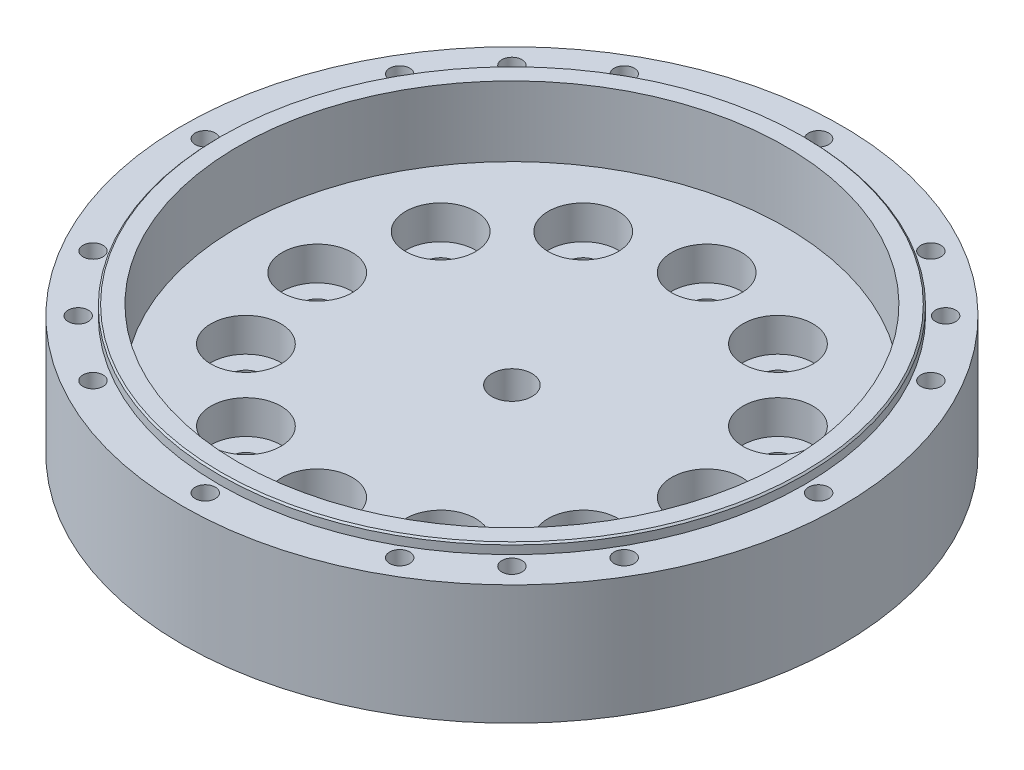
ISO-10303-21;
HEADER;
FILE_DESCRIPTION(('STEP AP214'),'2;1');
FILE_NAME('part.step','',(''),(''),'','','');
FILE_SCHEMA(('AUTOMOTIVE_DESIGN { 1 0 10303 214 1 1 1 1 }'));
ENDSEC;
DATA;
#1=APPLICATION_CONTEXT('core data for automotive mechanical design processes');
#2=APPLICATION_PROTOCOL_DEFINITION('international standard','automotive_design',2000,#1);
#3=PRODUCT_CONTEXT('',#1,'mechanical');
#4=PRODUCT('Part','Part','',(#3));
#5=PRODUCT_RELATED_PRODUCT_CATEGORY('part','',(#4));
#6=PRODUCT_DEFINITION_FORMATION('','',#4);
#7=PRODUCT_DEFINITION_CONTEXT('part definition',#1,'design');
#8=PRODUCT_DEFINITION('design','',#6,#7);
#9=PRODUCT_DEFINITION_SHAPE('','',#8);
#10=(LENGTH_UNIT() NAMED_UNIT(*) SI_UNIT(.MILLI.,.METRE.));
#11=(NAMED_UNIT(*) PLANE_ANGLE_UNIT() SI_UNIT($,.RADIAN.));
#12=(NAMED_UNIT(*) SI_UNIT($,.STERADIAN.) SOLID_ANGLE_UNIT());
#13=UNCERTAINTY_MEASURE_WITH_UNIT(LENGTH_MEASURE(1.E-05),#10,'distance_accuracy_value','');
#14=(GEOMETRIC_REPRESENTATION_CONTEXT(3) GLOBAL_UNCERTAINTY_ASSIGNED_CONTEXT((#13)) GLOBAL_UNIT_ASSIGNED_CONTEXT((#10,
#11,#12)) REPRESENTATION_CONTEXT('',''));
#15=CARTESIAN_POINT('',(0.,0.,0.));
#16=DIRECTION('',(0.,0.,1.));
#17=DIRECTION('',(1.,0.,0.));
#18=AXIS2_PLACEMENT_3D('',#15,#16,#17);
#19=CARTESIAN_POINT('',(0.,60.3249999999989,0.));
#20=DIRECTION('',(0.,-1.,0.));
#21=DIRECTION('',(0.,0.,-1.));
#22=AXIS2_PLACEMENT_3D('',#19,#20,#21);
#23=PLANE('',#22);
#24=CARTESIAN_POINT('',(0.,60.3249999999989,0.));
#25=DIRECTION('',(0.,1.,0.));
#26=DIRECTION('',(0.,0.,1.));
#27=AXIS2_PLACEMENT_3D('',#24,#25,#26);
#28=CIRCLE('',#27,104.775000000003);
#29=CARTESIAN_POINT('',(0.,60.3249999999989,104.775000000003));
#30=VERTEX_POINT('',#29);
#31=EDGE_CURVE('E56',#30,#30,#28,.T.);
#32=ORIENTED_EDGE('',*,*,#31,.T.);
#33=EDGE_LOOP('',(#32));
#34=FACE_BOUND('',#33,.T.);
#35=CARTESIAN_POINT('',(48.7499999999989,60.3249999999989,-84.4374768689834));
#36=DIRECTION('',(0.,-1.,0.));
#37=DIRECTION('',(0.,0.,-1.));
#38=AXIS2_PLACEMENT_3D('',#35,#36,#37);
#39=CIRCLE('',#38,3.19999999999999);
#40=CARTESIAN_POINT('',(48.7499999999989,60.3249999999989,-87.6374768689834));
#41=VERTEX_POINT('',#40);
#42=EDGE_CURVE('E125',#41,#41,#39,.T.);
#43=ORIENTED_EDGE('',*,*,#42,.T.);
#44=EDGE_LOOP('',(#43));
#45=FACE_BOUND('',#44,.T.);
#46=CARTESIAN_POINT('',(84.4374768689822,60.3249999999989,-48.750000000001));
#47=DIRECTION('',(0.,-1.,0.));
#48=DIRECTION('',(0.,0.,-1.));
#49=AXIS2_PLACEMENT_3D('',#46,#47,#48);
#50=CIRCLE('',#49,3.19999999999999);
#51=CARTESIAN_POINT('',(84.4374768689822,60.3249999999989,-51.950000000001));
#52=VERTEX_POINT('',#51);
#53=EDGE_CURVE('E137',#52,#52,#50,.T.);
#54=ORIENTED_EDGE('',*,*,#53,.T.);
#55=EDGE_LOOP('',(#54));
#56=FACE_BOUND('',#55,.T.);
#57=CARTESIAN_POINT('',(97.5,60.3249999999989,-1.02834407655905E-12));
#58=DIRECTION('',(0.,-1.,0.));
#59=DIRECTION('',(0.,0.,-1.));
#60=AXIS2_PLACEMENT_3D('',#57,#58,#59);
#61=CIRCLE('',#60,3.19999999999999);
#62=CARTESIAN_POINT('',(97.5,60.3249999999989,-3.20000000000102));
#63=VERTEX_POINT('',#62);
#64=EDGE_CURVE('E149',#63,#63,#61,.T.);
#65=ORIENTED_EDGE('',*,*,#64,.T.);
#66=EDGE_LOOP('',(#65));
#67=FACE_BOUND('',#66,.T.);
#68=CARTESIAN_POINT('',(84.4374768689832,60.3249999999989,48.7499999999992));
#69=DIRECTION('',(0.,-1.,0.));
#70=DIRECTION('',(0.,0.,-1.));
#71=AXIS2_PLACEMENT_3D('',#68,#69,#70);
#72=CIRCLE('',#71,3.19999999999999);
#73=CARTESIAN_POINT('',(84.4374768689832,60.3249999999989,45.5499999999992));
#74=VERTEX_POINT('',#73);
#75=EDGE_CURVE('E161',#74,#74,#72,.T.);
#76=ORIENTED_EDGE('',*,*,#75,.T.);
#77=EDGE_LOOP('',(#76));
#78=FACE_BOUND('',#77,.T.);
#79=CARTESIAN_POINT('',(48.7500000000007,60.3249999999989,84.4374768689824));
#80=DIRECTION('',(0.,-1.,0.));
#81=DIRECTION('',(0.,0.,-1.));
#82=AXIS2_PLACEMENT_3D('',#79,#80,#81);
#83=CIRCLE('',#82,3.19999999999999);
#84=CARTESIAN_POINT('',(48.7500000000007,60.3249999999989,81.2374768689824));
#85=VERTEX_POINT('',#84);
#86=EDGE_CURVE('E173',#85,#85,#83,.T.);
#87=ORIENTED_EDGE('',*,*,#86,.T.);
#88=EDGE_LOOP('',(#87));
#89=FACE_BOUND('',#88,.T.);
#90=CARTESIAN_POINT('',(6.7972322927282E-13,60.3249999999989,97.5));
#91=DIRECTION('',(0.,-1.,0.));
#92=DIRECTION('',(0.,0.,-1.));
#93=AXIS2_PLACEMENT_3D('',#90,#91,#92);
#94=CIRCLE('',#93,3.19999999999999);
#95=CARTESIAN_POINT('',(6.7972322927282E-13,60.3249999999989,94.3));
#96=VERTEX_POINT('',#95);
#97=EDGE_CURVE('E185',#96,#96,#94,.T.);
#98=ORIENTED_EDGE('',*,*,#97,.T.);
#99=EDGE_LOOP('',(#98));
#100=FACE_BOUND('',#99,.T.);
#101=CARTESIAN_POINT('',(-48.7499999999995,60.3249999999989,84.4374768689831));
#102=DIRECTION('',(0.,-1.,0.));
#103=DIRECTION('',(0.,0.,-1.));
#104=AXIS2_PLACEMENT_3D('',#101,#102,#103);
#105=CIRCLE('',#104,3.19999999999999);
#106=CARTESIAN_POINT('',(-48.7499999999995,60.3249999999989,81.2374768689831));
#107=VERTEX_POINT('',#106);
#108=EDGE_CURVE('E197',#107,#107,#105,.T.);
#109=ORIENTED_EDGE('',*,*,#108,.T.);
#110=EDGE_LOOP('',(#109));
#111=FACE_BOUND('',#110,.T.);
#112=CARTESIAN_POINT('',(-84.4374768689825,60.3249999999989,48.7500000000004));
#113=DIRECTION('',(0.,-1.,0.));
#114=DIRECTION('',(0.,0.,-1.));
#115=AXIS2_PLACEMENT_3D('',#112,#113,#114);
#116=CIRCLE('',#115,3.19999999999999);
#117=CARTESIAN_POINT('',(-84.4374768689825,60.3249999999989,45.5500000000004));
#118=VERTEX_POINT('',#117);
#119=EDGE_CURVE('E209',#118,#118,#116,.T.);
#120=ORIENTED_EDGE('',*,*,#119,.T.);
#121=EDGE_LOOP('',(#120));
#122=FACE_BOUND('',#121,.T.);
#123=CARTESIAN_POINT('',(-97.5,60.3249999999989,1.71390679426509E-12));
#124=DIRECTION('',(0.,-1.,0.));
#125=DIRECTION('',(0.,0.,-1.));
#126=AXIS2_PLACEMENT_3D('',#123,#124,#125);
#127=CIRCLE('',#126,3.19999999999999);
#128=CARTESIAN_POINT('',(-97.5,60.3249999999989,-3.19999999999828));
#129=VERTEX_POINT('',#128);
#130=EDGE_CURVE('E221',#129,#129,#127,.T.);
#131=ORIENTED_EDGE('',*,*,#130,.T.);
#132=EDGE_LOOP('',(#131));
#133=FACE_BOUND('',#132,.T.);
#134=CARTESIAN_POINT('',(-84.4374768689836,60.3249999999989,-48.7499999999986));
#135=DIRECTION('',(0.,-1.,0.));
#136=DIRECTION('',(0.,0.,-1.));
#137=AXIS2_PLACEMENT_3D('',#134,#135,#136);
#138=CIRCLE('',#137,3.19999999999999);
#139=CARTESIAN_POINT('',(-84.4374768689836,60.3249999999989,-51.9499999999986));
#140=VERTEX_POINT('',#139);
#141=EDGE_CURVE('E233',#140,#140,#138,.T.);
#142=ORIENTED_EDGE('',*,*,#141,.T.);
#143=EDGE_LOOP('',(#142));
#144=FACE_BOUND('',#143,.T.);
#145=CARTESIAN_POINT('',(-48.7500000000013,60.3249999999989,-84.437476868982));
#146=DIRECTION('',(0.,-1.,0.));
#147=DIRECTION('',(0.,0.,-1.));
#148=AXIS2_PLACEMENT_3D('',#145,#146,#147);
#149=CIRCLE('',#148,3.19999999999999);
#150=CARTESIAN_POINT('',(-48.7500000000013,60.3249999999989,-87.637476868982));
#151=VERTEX_POINT('',#150);
#152=EDGE_CURVE('E245',#151,#151,#149,.T.);
#153=ORIENTED_EDGE('',*,*,#152,.T.);
#154=EDGE_LOOP('',(#153));
#155=FACE_BOUND('',#154,.T.);
#156=CARTESIAN_POINT('',(0.,60.3249999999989,-97.5));
#157=DIRECTION('',(0.,-1.,0.));
#158=DIRECTION('',(0.,0.,-1.));
#159=AXIS2_PLACEMENT_3D('',#156,#157,#158);
#160=CIRCLE('',#159,3.19999999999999);
#161=CARTESIAN_POINT('',(0.,60.3249999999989,-100.7));
#162=VERTEX_POINT('',#161);
#163=EDGE_CURVE('E257',#162,#162,#160,.T.);
#164=ORIENTED_EDGE('',*,*,#163,.T.);
#165=EDGE_LOOP('',(#164));
#166=FACE_BOUND('',#165,.T.);
#167=CARTESIAN_POINT('',(68.9429111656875,60.3249999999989,-68.9429111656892));
#168=DIRECTION('',(0.,-1.,0.));
#169=DIRECTION('',(0.,0.,-1.));
#170=AXIS2_PLACEMENT_3D('',#167,#168,#169);
#171=CIRCLE('',#170,3.19999999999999);
#172=CARTESIAN_POINT('',(68.9429111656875,60.3249999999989,-72.1429111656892));
#173=VERTEX_POINT('',#172);
#174=EDGE_CURVE('E269',#173,#173,#171,.T.);
#175=ORIENTED_EDGE('',*,*,#174,.T.);
#176=EDGE_LOOP('',(#175));
#177=FACE_BOUND('',#176,.T.);
#178=CARTESIAN_POINT('',(68.9429111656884,60.3249999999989,68.9429111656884));
#179=DIRECTION('',(0.,-1.,0.));
#180=DIRECTION('',(0.,0.,-1.));
#181=AXIS2_PLACEMENT_3D('',#178,#179,#180);
#182=CIRCLE('',#181,3.19999999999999);
#183=CARTESIAN_POINT('',(68.9429111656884,60.3249999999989,65.7429111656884));
#184=VERTEX_POINT('',#183);
#185=EDGE_CURVE('E281',#184,#184,#182,.T.);
#186=ORIENTED_EDGE('',*,*,#185,.T.);
#187=EDGE_LOOP('',(#186));
#188=FACE_BOUND('',#187,.T.);
#189=CARTESIAN_POINT('',(-68.9429111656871,60.3249999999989,68.9429111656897));
#190=DIRECTION('',(0.,-1.,0.));
#191=DIRECTION('',(0.,0.,-1.));
#192=AXIS2_PLACEMENT_3D('',#189,#190,#191);
#193=CIRCLE('',#192,3.19999999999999);
#194=CARTESIAN_POINT('',(-68.9429111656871,60.3249999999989,65.7429111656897));
#195=VERTEX_POINT('',#194);
#196=EDGE_CURVE('E293',#195,#195,#193,.T.);
#197=ORIENTED_EDGE('',*,*,#196,.T.);
#198=EDGE_LOOP('',(#197));
#199=FACE_BOUND('',#198,.T.);
#200=CARTESIAN_POINT('',(-68.9429111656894,60.3249999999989,-68.9429111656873));
#201=DIRECTION('',(0.,-1.,0.));
#202=DIRECTION('',(0.,0.,-1.));
#203=AXIS2_PLACEMENT_3D('',#200,#201,#202);
#204=CIRCLE('',#203,3.19999999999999);
#205=CARTESIAN_POINT('',(-68.9429111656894,60.3249999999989,-72.1429111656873));
#206=VERTEX_POINT('',#205);
#207=EDGE_CURVE('E305',#206,#206,#204,.T.);
#208=ORIENTED_EDGE('',*,*,#207,.T.);
#209=EDGE_LOOP('',(#208));
#210=FACE_BOUND('',#209,.T.);
#211=CARTESIAN_POINT('',(0.,60.3249999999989,0.));
#212=DIRECTION('',(0.,-1.,0.));
#213=DIRECTION('',(0.,0.,-1.));
#214=AXIS2_PLACEMENT_3D('',#211,#212,#213);
#215=CIRCLE('',#214,92.9894);
#216=CARTESIAN_POINT('',(0.,60.3249999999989,-92.9894));
#217=VERTEX_POINT('',#216);
#218=EDGE_CURVE('E51',#217,#217,#215,.F.);
#219=ORIENTED_EDGE('',*,*,#218,.F.);
#220=EDGE_LOOP('',(#219));
#221=FACE_BOUND('',#220,.T.);
#222=ADVANCED_FACE('F39',(#34,#45,#56,#67,#78,#89,#100,#111,#122,#133,#144,#155,#166,#177,#188,
#199,#210,#221),#23,.F.);
#223=CARTESIAN_POINT('',(0.,22.2249999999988,0.));
#224=DIRECTION('',(0.,-1.,0.));
#225=DIRECTION('',(0.,0.,-1.));
#226=AXIS2_PLACEMENT_3D('',#223,#224,#225);
#227=PLANE('',#226);
#228=CARTESIAN_POINT('',(0.,22.2249999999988,0.));
#229=DIRECTION('',(0.,-1.,0.));
#230=DIRECTION('',(0.,0.,-1.));
#231=AXIS2_PLACEMENT_3D('',#228,#229,#230);
#232=CIRCLE('',#231,6.3627);
#233=CARTESIAN_POINT('',(0.,22.2249999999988,-6.3627));
#234=VERTEX_POINT('',#233);
#235=EDGE_CURVE('E404',#234,#234,#232,.T.);
#236=ORIENTED_EDGE('',*,*,#235,.F.);
#237=EDGE_LOOP('',(#236));
#238=FACE_BOUND('',#237,.T.);
#239=CARTESIAN_POINT('',(0.,22.2249999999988,-61.9125));
#240=DIRECTION('',(0.,-1.,0.));
#241=DIRECTION('',(0.,0.,-1.));
#242=AXIS2_PLACEMENT_3D('',#239,#240,#241);
#243=CIRCLE('',#242,4.9022);
#244=CARTESIAN_POINT('',(0.,22.2249999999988,-66.8147));
#245=VERTEX_POINT('',#244);
#246=EDGE_CURVE('E57',#245,#245,#243,.T.);
#247=ORIENTED_EDGE('',*,*,#246,.F.);
#248=EDGE_LOOP('',(#247));
#249=FACE_BOUND('',#248,.T.);
#250=CARTESIAN_POINT('',(30.95625,22.2249999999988,-53.6177978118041));
#251=DIRECTION('',(0.,-1.,0.));
#252=DIRECTION('',(0.,0.,-1.));
#253=AXIS2_PLACEMENT_3D('',#250,#251,#252);
#254=CIRCLE('',#253,4.9022);
#255=CARTESIAN_POINT('',(30.95625,22.2249999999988,-58.5199978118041));
#256=VERTEX_POINT('',#255);
#257=EDGE_CURVE('E62',#256,#256,#254,.T.);
#258=ORIENTED_EDGE('',*,*,#257,.F.);
#259=EDGE_LOOP('',(#258));
#260=FACE_BOUND('',#259,.T.);
#261=CARTESIAN_POINT('',(53.6177978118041,22.2249999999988,-30.95625));
#262=DIRECTION('',(0.,-1.,0.));
#263=DIRECTION('',(0.,0.,-1.));
#264=AXIS2_PLACEMENT_3D('',#261,#262,#263);
#265=CIRCLE('',#264,4.9022);
#266=CARTESIAN_POINT('',(53.6177978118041,22.2249999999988,-35.85845));
#267=VERTEX_POINT('',#266);
#268=EDGE_CURVE('E67',#267,#267,#265,.T.);
#269=ORIENTED_EDGE('',*,*,#268,.F.);
#270=EDGE_LOOP('',(#269));
#271=FACE_BOUND('',#270,.T.);
#272=CARTESIAN_POINT('',(61.9125,22.2249999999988,0.));
#273=DIRECTION('',(0.,-1.,0.));
#274=DIRECTION('',(0.,0.,-1.));
#275=AXIS2_PLACEMENT_3D('',#272,#273,#274);
#276=CIRCLE('',#275,4.9022);
#277=CARTESIAN_POINT('',(61.9125,22.2249999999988,-4.9022));
#278=VERTEX_POINT('',#277);
#279=EDGE_CURVE('E72',#278,#278,#276,.T.);
#280=ORIENTED_EDGE('',*,*,#279,.F.);
#281=EDGE_LOOP('',(#280));
#282=FACE_BOUND('',#281,.T.);
#283=CARTESIAN_POINT('',(53.6177978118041,22.2249999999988,30.95625));
#284=DIRECTION('',(0.,-1.,0.));
#285=DIRECTION('',(0.,0.,-1.));
#286=AXIS2_PLACEMENT_3D('',#283,#284,#285);
#287=CIRCLE('',#286,4.9022);
#288=CARTESIAN_POINT('',(53.6177978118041,22.2249999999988,26.05405));
#289=VERTEX_POINT('',#288);
#290=EDGE_CURVE('E77',#289,#289,#287,.T.);
#291=ORIENTED_EDGE('',*,*,#290,.F.);
#292=EDGE_LOOP('',(#291));
#293=FACE_BOUND('',#292,.T.);
#294=CARTESIAN_POINT('',(30.95625,22.2249999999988,53.6177978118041));
#295=DIRECTION('',(0.,-1.,0.));
#296=DIRECTION('',(0.,0.,-1.));
#297=AXIS2_PLACEMENT_3D('',#294,#295,#296);
#298=CIRCLE('',#297,4.9022);
#299=CARTESIAN_POINT('',(30.95625,22.2249999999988,48.7155978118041));
#300=VERTEX_POINT('',#299);
#301=EDGE_CURVE('E82',#300,#300,#298,.T.);
#302=ORIENTED_EDGE('',*,*,#301,.F.);
#303=EDGE_LOOP('',(#302));
#304=FACE_BOUND('',#303,.T.);
#305=CARTESIAN_POINT('',(0.,22.2249999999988,61.9125));
#306=DIRECTION('',(0.,-1.,0.));
#307=DIRECTION('',(0.,0.,-1.));
#308=AXIS2_PLACEMENT_3D('',#305,#306,#307);
#309=CIRCLE('',#308,4.9022);
#310=CARTESIAN_POINT('',(0.,22.2249999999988,57.0103));
#311=VERTEX_POINT('',#310);
#312=EDGE_CURVE('E87',#311,#311,#309,.T.);
#313=ORIENTED_EDGE('',*,*,#312,.F.);
#314=EDGE_LOOP('',(#313));
#315=FACE_BOUND('',#314,.T.);
#316=CARTESIAN_POINT('',(-30.95625,22.2249999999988,53.6177978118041));
#317=DIRECTION('',(0.,-1.,0.));
#318=DIRECTION('',(0.,0.,-1.));
#319=AXIS2_PLACEMENT_3D('',#316,#317,#318);
#320=CIRCLE('',#319,4.9022);
#321=CARTESIAN_POINT('',(-30.95625,22.2249999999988,48.7155978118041));
#322=VERTEX_POINT('',#321);
#323=EDGE_CURVE('E92',#322,#322,#320,.T.);
#324=ORIENTED_EDGE('',*,*,#323,.F.);
#325=EDGE_LOOP('',(#324));
#326=FACE_BOUND('',#325,.T.);
#327=CARTESIAN_POINT('',(-53.6177978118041,22.2249999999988,30.95625));
#328=DIRECTION('',(0.,-1.,0.));
#329=DIRECTION('',(0.,0.,-1.));
#330=AXIS2_PLACEMENT_3D('',#327,#328,#329);
#331=CIRCLE('',#330,4.9022);
#332=CARTESIAN_POINT('',(-53.6177978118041,22.2249999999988,26.05405));
#333=VERTEX_POINT('',#332);
#334=EDGE_CURVE('E97',#333,#333,#331,.T.);
#335=ORIENTED_EDGE('',*,*,#334,.F.);
#336=EDGE_LOOP('',(#335));
#337=FACE_BOUND('',#336,.T.);
#338=CARTESIAN_POINT('',(-61.9125,22.2249999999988,0.));
#339=DIRECTION('',(0.,-1.,0.));
#340=DIRECTION('',(0.,0.,-1.));
#341=AXIS2_PLACEMENT_3D('',#338,#339,#340);
#342=CIRCLE('',#341,4.9022);
#343=CARTESIAN_POINT('',(-61.9125,22.2249999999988,-4.90219999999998));
#344=VERTEX_POINT('',#343);
#345=EDGE_CURVE('E102',#344,#344,#342,.T.);
#346=ORIENTED_EDGE('',*,*,#345,.F.);
#347=EDGE_LOOP('',(#346));
#348=FACE_BOUND('',#347,.T.);
#349=CARTESIAN_POINT('',(-53.6177978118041,22.2249999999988,-30.95625));
#350=DIRECTION('',(0.,-1.,0.));
#351=DIRECTION('',(0.,0.,-1.));
#352=AXIS2_PLACEMENT_3D('',#349,#350,#351);
#353=CIRCLE('',#352,4.9022);
#354=CARTESIAN_POINT('',(-53.6177978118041,22.2249999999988,-35.85845));
#355=VERTEX_POINT('',#354);
#356=EDGE_CURVE('E107',#355,#355,#353,.T.);
#357=ORIENTED_EDGE('',*,*,#356,.F.);
#358=EDGE_LOOP('',(#357));
#359=FACE_BOUND('',#358,.T.);
#360=CARTESIAN_POINT('',(-30.95625,22.2249999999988,-53.6177978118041));
#361=DIRECTION('',(0.,-1.,0.));
#362=DIRECTION('',(0.,0.,-1.));
#363=AXIS2_PLACEMENT_3D('',#360,#361,#362);
#364=CIRCLE('',#363,4.9022);
#365=CARTESIAN_POINT('',(-30.95625,22.2249999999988,-58.5199978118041));
#366=VERTEX_POINT('',#365);
#367=EDGE_CURVE('E112',#366,#366,#364,.T.);
#368=ORIENTED_EDGE('',*,*,#367,.F.);
#369=EDGE_LOOP('',(#368));
#370=FACE_BOUND('',#369,.T.);
#371=CARTESIAN_POINT('',(-68.9429111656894,22.2249999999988,-68.9429111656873));
#372=DIRECTION('',(0.,-1.,0.));
#373=DIRECTION('',(0.,0.,-1.));
#374=AXIS2_PLACEMENT_3D('',#371,#372,#373);
#375=CIRCLE('',#374,5.49999999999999);
#376=CARTESIAN_POINT('',(-68.9429111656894,22.2249999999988,-74.4429111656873));
#377=VERTEX_POINT('',#376);
#378=EDGE_CURVE('E115',#377,#377,#375,.T.);
#379=ORIENTED_EDGE('',*,*,#378,.F.);
#380=EDGE_LOOP('',(#379));
#381=FACE_BOUND('',#380,.T.);
#382=CARTESIAN_POINT('',(-68.9429111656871,22.2249999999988,68.9429111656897));
#383=DIRECTION('',(0.,-1.,0.));
#384=DIRECTION('',(0.,0.,-1.));
#385=AXIS2_PLACEMENT_3D('',#382,#383,#384);
#386=CIRCLE('',#385,5.49999999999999);
#387=CARTESIAN_POINT('',(-68.9429111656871,22.2249999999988,63.4429111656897));
#388=VERTEX_POINT('',#387);
#389=EDGE_CURVE('E302',#388,#388,#386,.T.);
#390=ORIENTED_EDGE('',*,*,#389,.F.);
#391=EDGE_LOOP('',(#390));
#392=FACE_BOUND('',#391,.T.);
#393=CARTESIAN_POINT('',(68.9429111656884,22.2249999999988,68.9429111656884));
#394=DIRECTION('',(0.,-1.,0.));
#395=DIRECTION('',(0.,0.,-1.));
#396=AXIS2_PLACEMENT_3D('',#393,#394,#395);
#397=CIRCLE('',#396,5.50000000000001);
#398=CARTESIAN_POINT('',(68.9429111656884,22.2249999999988,63.4429111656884));
#399=VERTEX_POINT('',#398);
#400=EDGE_CURVE('E290',#399,#399,#397,.T.);
#401=ORIENTED_EDGE('',*,*,#400,.F.);
#402=EDGE_LOOP('',(#401));
#403=FACE_BOUND('',#402,.T.);
#404=CARTESIAN_POINT('',(68.9429111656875,22.2249999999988,-68.9429111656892));
#405=DIRECTION('',(0.,-1.,0.));
#406=DIRECTION('',(0.,0.,-1.));
#407=AXIS2_PLACEMENT_3D('',#404,#405,#406);
#408=CIRCLE('',#407,5.50000000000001);
#409=CARTESIAN_POINT('',(68.9429111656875,22.2249999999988,-74.4429111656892));
#410=VERTEX_POINT('',#409);
#411=EDGE_CURVE('E278',#410,#410,#408,.T.);
#412=ORIENTED_EDGE('',*,*,#411,.F.);
#413=EDGE_LOOP('',(#412));
#414=FACE_BOUND('',#413,.T.);
#415=CARTESIAN_POINT('',(0.,22.2249999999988,-97.5));
#416=DIRECTION('',(0.,-1.,0.));
#417=DIRECTION('',(0.,0.,-1.));
#418=AXIS2_PLACEMENT_3D('',#415,#416,#417);
#419=CIRCLE('',#418,5.5);
#420=CARTESIAN_POINT('',(0.,22.2249999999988,-103.));
#421=VERTEX_POINT('',#420);
#422=EDGE_CURVE('E266',#421,#421,#419,.T.);
#423=ORIENTED_EDGE('',*,*,#422,.F.);
#424=EDGE_LOOP('',(#423));
#425=FACE_BOUND('',#424,.T.);
#426=CARTESIAN_POINT('',(-48.7500000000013,22.2249999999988,-84.437476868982));
#427=DIRECTION('',(0.,-1.,0.));
#428=DIRECTION('',(0.,0.,-1.));
#429=AXIS2_PLACEMENT_3D('',#426,#427,#428);
#430=CIRCLE('',#429,5.5);
#431=CARTESIAN_POINT('',(-48.7500000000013,22.2249999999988,-89.937476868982));
#432=VERTEX_POINT('',#431);
#433=EDGE_CURVE('E254',#432,#432,#430,.T.);
#434=ORIENTED_EDGE('',*,*,#433,.F.);
#435=EDGE_LOOP('',(#434));
#436=FACE_BOUND('',#435,.T.);
#437=CARTESIAN_POINT('',(-84.4374768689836,22.2249999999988,-48.7499999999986));
#438=DIRECTION('',(0.,-1.,0.));
#439=DIRECTION('',(0.,0.,-1.));
#440=AXIS2_PLACEMENT_3D('',#437,#438,#439);
#441=CIRCLE('',#440,5.49999999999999);
#442=CARTESIAN_POINT('',(-84.4374768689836,22.2249999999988,-54.2499999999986));
#443=VERTEX_POINT('',#442);
#444=EDGE_CURVE('E242',#443,#443,#441,.T.);
#445=ORIENTED_EDGE('',*,*,#444,.F.);
#446=EDGE_LOOP('',(#445));
#447=FACE_BOUND('',#446,.T.);
#448=CARTESIAN_POINT('',(-97.5,22.2249999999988,1.71390679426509E-12));
#449=DIRECTION('',(0.,-1.,0.));
#450=DIRECTION('',(0.,0.,-1.));
#451=AXIS2_PLACEMENT_3D('',#448,#449,#450);
#452=CIRCLE('',#451,5.50000000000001);
#453=CARTESIAN_POINT('',(-97.5,22.2249999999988,-5.49999999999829));
#454=VERTEX_POINT('',#453);
#455=EDGE_CURVE('E230',#454,#454,#452,.T.);
#456=ORIENTED_EDGE('',*,*,#455,.F.);
#457=EDGE_LOOP('',(#456));
#458=FACE_BOUND('',#457,.T.);
#459=CARTESIAN_POINT('',(-84.4374768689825,22.2249999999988,48.7500000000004));
#460=DIRECTION('',(0.,-1.,0.));
#461=DIRECTION('',(0.,0.,-1.));
#462=AXIS2_PLACEMENT_3D('',#459,#460,#461);
#463=CIRCLE('',#462,5.49999999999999);
#464=CARTESIAN_POINT('',(-84.4374768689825,22.2249999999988,43.2500000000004));
#465=VERTEX_POINT('',#464);
#466=EDGE_CURVE('E218',#465,#465,#463,.T.);
#467=ORIENTED_EDGE('',*,*,#466,.F.);
#468=EDGE_LOOP('',(#467));
#469=FACE_BOUND('',#468,.T.);
#470=CARTESIAN_POINT('',(-48.7499999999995,22.2249999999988,84.4374768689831));
#471=DIRECTION('',(0.,-1.,0.));
#472=DIRECTION('',(0.,0.,-1.));
#473=AXIS2_PLACEMENT_3D('',#470,#471,#472);
#474=CIRCLE('',#473,5.5);
#475=CARTESIAN_POINT('',(-48.7499999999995,22.2249999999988,78.9374768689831));
#476=VERTEX_POINT('',#475);
#477=EDGE_CURVE('E206',#476,#476,#474,.T.);
#478=ORIENTED_EDGE('',*,*,#477,.F.);
#479=EDGE_LOOP('',(#478));
#480=FACE_BOUND('',#479,.T.);
#481=CARTESIAN_POINT('',(6.7972322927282E-13,22.2249999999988,97.5));
#482=DIRECTION('',(0.,-1.,0.));
#483=DIRECTION('',(0.,0.,-1.));
#484=AXIS2_PLACEMENT_3D('',#481,#482,#483);
#485=CIRCLE('',#484,5.5);
#486=CARTESIAN_POINT('',(6.7972322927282E-13,22.2249999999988,92.));
#487=VERTEX_POINT('',#486);
#488=EDGE_CURVE('E194',#487,#487,#485,.T.);
#489=ORIENTED_EDGE('',*,*,#488,.F.);
#490=EDGE_LOOP('',(#489));
#491=FACE_BOUND('',#490,.T.);
#492=CARTESIAN_POINT('',(48.7500000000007,22.2249999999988,84.4374768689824));
#493=DIRECTION('',(0.,-1.,0.));
#494=DIRECTION('',(0.,0.,-1.));
#495=AXIS2_PLACEMENT_3D('',#492,#493,#494);
#496=CIRCLE('',#495,5.5);
#497=CARTESIAN_POINT('',(48.7500000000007,22.2249999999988,78.9374768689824));
#498=VERTEX_POINT('',#497);
#499=EDGE_CURVE('E182',#498,#498,#496,.T.);
#500=ORIENTED_EDGE('',*,*,#499,.F.);
#501=EDGE_LOOP('',(#500));
#502=FACE_BOUND('',#501,.T.);
#503=CARTESIAN_POINT('',(84.4374768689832,22.2249999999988,48.7499999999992));
#504=DIRECTION('',(0.,-1.,0.));
#505=DIRECTION('',(0.,0.,-1.));
#506=AXIS2_PLACEMENT_3D('',#503,#504,#505);
#507=CIRCLE('',#506,5.49999999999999);
#508=CARTESIAN_POINT('',(84.4374768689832,22.2249999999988,43.2499999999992));
#509=VERTEX_POINT('',#508);
#510=EDGE_CURVE('E170',#509,#509,#507,.T.);
#511=ORIENTED_EDGE('',*,*,#510,.F.);
#512=EDGE_LOOP('',(#511));
#513=FACE_BOUND('',#512,.T.);
#514=CARTESIAN_POINT('',(97.5,22.2249999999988,-1.02834407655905E-12));
#515=DIRECTION('',(0.,-1.,0.));
#516=DIRECTION('',(0.,0.,-1.));
#517=AXIS2_PLACEMENT_3D('',#514,#515,#516);
#518=CIRCLE('',#517,5.50000000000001);
#519=CARTESIAN_POINT('',(97.5,22.2249999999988,-5.50000000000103));
#520=VERTEX_POINT('',#519);
#521=EDGE_CURVE('E158',#520,#520,#518,.T.);
#522=ORIENTED_EDGE('',*,*,#521,.F.);
#523=EDGE_LOOP('',(#522));
#524=FACE_BOUND('',#523,.T.);
#525=CARTESIAN_POINT('',(84.4374768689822,22.2249999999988,-48.750000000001));
#526=DIRECTION('',(0.,-1.,0.));
#527=DIRECTION('',(0.,0.,-1.));
#528=AXIS2_PLACEMENT_3D('',#525,#526,#527);
#529=CIRCLE('',#528,5.50000000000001);
#530=CARTESIAN_POINT('',(84.4374768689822,22.2249999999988,-54.250000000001));
#531=VERTEX_POINT('',#530);
#532=EDGE_CURVE('E146',#531,#531,#529,.T.);
#533=ORIENTED_EDGE('',*,*,#532,.F.);
#534=EDGE_LOOP('',(#533));
#535=FACE_BOUND('',#534,.T.);
#536=CARTESIAN_POINT('',(48.7499999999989,22.2249999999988,-84.4374768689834));
#537=DIRECTION('',(0.,-1.,0.));
#538=DIRECTION('',(0.,0.,-1.));
#539=AXIS2_PLACEMENT_3D('',#536,#537,#538);
#540=CIRCLE('',#539,5.5);
#541=CARTESIAN_POINT('',(48.7499999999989,22.2249999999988,-89.9374768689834));
#542=VERTEX_POINT('',#541);
#543=EDGE_CURVE('E134',#542,#542,#540,.T.);
#544=ORIENTED_EDGE('',*,*,#543,.F.);
#545=EDGE_LOOP('',(#544));
#546=FACE_BOUND('',#545,.T.);
#547=CARTESIAN_POINT('',(0.,22.2249999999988,0.));
#548=DIRECTION('',(0.,1.,0.));
#549=DIRECTION('',(0.,0.,1.));
#550=AXIS2_PLACEMENT_3D('',#547,#548,#549);
#551=CIRCLE('',#550,104.775000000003);
#552=CARTESIAN_POINT('',(0.,22.2249999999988,104.775000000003));
#553=VERTEX_POINT('',#552);
#554=EDGE_CURVE('E119',#553,#553,#551,.T.);
#555=ORIENTED_EDGE('',*,*,#554,.F.);
#556=EDGE_LOOP('',(#555));
#557=FACE_BOUND('',#556,.T.);
#558=ADVANCED_FACE('F467',(#238,#249,#260,#271,#282,#293,#304,#315,#326,#337,#348,#359,#370,
#381,#392,#403,#414,#425,#436,#447,#458,#469,#480,#491,#502,#513,#524,#535,#546,#557),#227,.T.);
#559=CARTESIAN_POINT('',(0.,0.,0.));
#560=DIRECTION('',(0.,1.,0.));
#561=DIRECTION('',(0.,0.,1.));
#562=AXIS2_PLACEMENT_3D('',#559,#560,#561);
#563=CYLINDRICAL_SURFACE('',#562,104.775000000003);
#564=ORIENTED_EDGE('',*,*,#31,.F.);
#565=EDGE_LOOP('',(#564));
#566=FACE_BOUND('',#565,.T.);
#567=ORIENTED_EDGE('',*,*,#554,.T.);
#568=EDGE_LOOP('',(#567));
#569=FACE_BOUND('',#568,.T.);
#570=ADVANCED_FACE('F447',(#566,#569),#563,.T.);
#571=CARTESIAN_POINT('',(0.,41.2749999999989,0.));
#572=DIRECTION('',(0.,1.,0.));
#573=DIRECTION('',(0.,0.,1.));
#574=AXIS2_PLACEMENT_3D('',#571,#572,#573);
#575=CYLINDRICAL_SURFACE('',#574,87.);
#576=CARTESIAN_POINT('',(0.,41.2749999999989,0.));
#577=DIRECTION('',(0.,1.,0.));
#578=DIRECTION('',(0.,0.,1.));
#579=AXIS2_PLACEMENT_3D('',#576,#577,#578);
#580=CIRCLE('',#579,87.);
#581=CARTESIAN_POINT('',(0.,41.2749999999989,87.));
#582=VERTEX_POINT('',#581);
#583=EDGE_CURVE('E122',#582,#582,#580,.T.);
#584=CARTESIAN_POINT('',(0.,63.4999999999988,0.));
#585=DIRECTION('',(0.,1.,0.));
#586=DIRECTION('',(0.,0.,1.));
#587=AXIS2_PLACEMENT_3D('',#584,#585,#586);
#588=CIRCLE('',#587,87.);
#589=CARTESIAN_POINT('',(0.,63.4999999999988,87.));
#590=VERTEX_POINT('',#589);
#591=EDGE_CURVE('E401',#590,#590,#588,.T.);
#592=CARTESIAN_POINT('',(0.,41.2749999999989,87.));
#593=CARTESIAN_POINT('',(0.,41.5065104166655,87.));
#594=CARTESIAN_POINT('',(0.,41.7380208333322,87.));
#595=CARTESIAN_POINT('',(0.,42.2010416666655,87.));
#596=CARTESIAN_POINT('',(0.,42.4325520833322,87.));
#597=CARTESIAN_POINT('',(0.,42.8955729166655,87.));
#598=CARTESIAN_POINT('',(0.,43.1270833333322,87.));
#599=CARTESIAN_POINT('',(0.,43.5901041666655,87.));
#600=CARTESIAN_POINT('',(0.,43.8216145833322,87.));
#601=CARTESIAN_POINT('',(0.,44.2846354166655,87.));
#602=CARTESIAN_POINT('',(0.,44.5161458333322,87.));
#603=CARTESIAN_POINT('',(0.,44.9791666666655,87.));
#604=CARTESIAN_POINT('',(0.,45.2106770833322,87.));
#605=CARTESIAN_POINT('',(0.,45.6736979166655,87.));
#606=CARTESIAN_POINT('',(0.,45.9052083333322,87.));
#607=CARTESIAN_POINT('',(0.,46.3682291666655,87.));
#608=CARTESIAN_POINT('',(0.,46.5997395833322,87.));
#609=CARTESIAN_POINT('',(0.,47.0627604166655,87.));
#610=CARTESIAN_POINT('',(0.,47.2942708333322,87.));
#611=CARTESIAN_POINT('',(0.,47.7572916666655,87.));
#612=CARTESIAN_POINT('',(0.,47.9888020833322,87.));
#613=CARTESIAN_POINT('',(0.,48.4518229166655,87.));
#614=CARTESIAN_POINT('',(0.,48.6833333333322,87.));
#615=CARTESIAN_POINT('',(0.,49.1463541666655,87.));
#616=CARTESIAN_POINT('',(0.,49.3778645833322,87.));
#617=CARTESIAN_POINT('',(0.,49.8408854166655,87.));
#618=CARTESIAN_POINT('',(0.,50.0723958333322,87.));
#619=CARTESIAN_POINT('',(0.,50.5354166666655,87.));
#620=CARTESIAN_POINT('',(0.,50.7669270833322,87.));
#621=CARTESIAN_POINT('',(0.,51.2299479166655,87.));
#622=CARTESIAN_POINT('',(0.,51.4614583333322,87.));
#623=CARTESIAN_POINT('',(0.,51.9244791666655,87.));
#624=CARTESIAN_POINT('',(0.,52.1559895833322,87.));
#625=CARTESIAN_POINT('',(0.,52.6190104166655,87.));
#626=CARTESIAN_POINT('',(0.,52.8505208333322,87.));
#627=CARTESIAN_POINT('',(0.,53.3135416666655,87.));
#628=CARTESIAN_POINT('',(0.,53.5450520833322,87.));
#629=CARTESIAN_POINT('',(0.,54.0080729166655,87.));
#630=CARTESIAN_POINT('',(0.,54.2395833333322,87.));
#631=CARTESIAN_POINT('',(0.,54.7026041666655,87.));
#632=CARTESIAN_POINT('',(0.,54.9341145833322,87.));
#633=CARTESIAN_POINT('',(0.,55.3971354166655,87.));
#634=CARTESIAN_POINT('',(0.,55.6286458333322,87.));
#635=CARTESIAN_POINT('',(0.,56.0916666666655,87.));
#636=CARTESIAN_POINT('',(0.,56.3231770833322,87.));
#637=CARTESIAN_POINT('',(0.,56.7861979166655,87.));
#638=CARTESIAN_POINT('',(0.,57.0177083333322,87.));
#639=CARTESIAN_POINT('',(0.,57.4807291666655,87.));
#640=CARTESIAN_POINT('',(0.,57.7122395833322,87.));
#641=CARTESIAN_POINT('',(0.,58.1752604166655,87.));
#642=CARTESIAN_POINT('',(0.,58.4067708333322,87.));
#643=CARTESIAN_POINT('',(0.,58.8697916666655,87.));
#644=CARTESIAN_POINT('',(0.,59.1013020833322,87.));
#645=CARTESIAN_POINT('',(0.,59.5643229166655,87.));
#646=CARTESIAN_POINT('',(0.,59.7958333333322,87.));
#647=CARTESIAN_POINT('',(0.,60.2588541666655,87.));
#648=CARTESIAN_POINT('',(0.,60.4903645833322,87.));
#649=CARTESIAN_POINT('',(0.,60.9533854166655,87.));
#650=CARTESIAN_POINT('',(0.,61.1848958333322,87.));
#651=CARTESIAN_POINT('',(0.,61.6479166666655,87.));
#652=CARTESIAN_POINT('',(0.,61.8794270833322,87.));
#653=CARTESIAN_POINT('',(0.,62.3424479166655,87.));
#654=CARTESIAN_POINT('',(0.,62.5739583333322,87.));
#655=CARTESIAN_POINT('',(0.,63.0369791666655,87.));
#656=CARTESIAN_POINT('',(0.,63.2684895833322,87.));
#657=CARTESIAN_POINT('',(0.,63.4999999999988,87.));
#658=B_SPLINE_CURVE_WITH_KNOTS('',3,(#592,#593,#594,#595,#596,#597,#598,#599,#600,#601,#602,
#603,#604,#605,#606,#607,#608,#609,#610,#611,#612,#613,#614,#615,#616,#617,#618,#619,#620,#621,
#622,#623,#624,#625,#626,#627,#628,#629,#630,#631,#632,#633,#634,#635,#636,#637,#638,#639,#640,
#641,#642,#643,#644,#645,#646,#647,#648,#649,#650,#651,#652,#653,#654,#655,#656,#657),
.UNSPECIFIED.,.F.,.F.,(4,2,2,2,2,2,2,2,2,2,2,2,2,2,2,2,2,2,2,2,2,2,2,2,2,2,2,2,2,2,2,2,4),(0.,
0.694531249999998,1.3890625,2.08359374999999,2.77812499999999,3.47265625,4.1671875,
4.86171874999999,5.55625,6.25078125,6.94531249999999,7.63984374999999,8.33437499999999,
9.02890625,9.72343749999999,10.41796875,11.1125,11.80703125,12.5015625,13.19609375,13.890625,
14.58515625,15.2796875,15.97421875,16.66875,17.36328125,18.0578125,18.75234375,19.446875,
20.14140625,20.8359375,21.53046875,22.225),.UNSPECIFIED.);
#659=EDGE_CURVE('BSEAM417',#582,#590,#658,.T.);
#660=ORIENTED_EDGE('',*,*,#583,.F.);
#661=ORIENTED_EDGE('',*,*,#591,.T.);
#662=ORIENTED_EDGE('',*,*,#659,.T.);
#663=ORIENTED_EDGE('',*,*,#659,.F.);
#664=EDGE_LOOP('',(#660,#662,#661,#663));
#665=FACE_BOUND('',#664,.T.);
#666=ADVANCED_FACE('F417',(#665),#575,.F.);
#667=CARTESIAN_POINT('',(0.,41.2749999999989,0.));
#668=DIRECTION('',(0.,1.,0.));
#669=DIRECTION('',(0.,0.,1.));
#670=AXIS2_PLACEMENT_3D('',#667,#668,#669);
#671=PLANE('',#670);
#672=CARTESIAN_POINT('',(0.,41.2749999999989,0.));
#673=DIRECTION('',(0.,1.,0.));
#674=DIRECTION('',(0.,0.,1.));
#675=AXIS2_PLACEMENT_3D('',#672,#673,#674);
#676=CIRCLE('',#675,6.3627);
#677=CARTESIAN_POINT('',(0.,41.2749999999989,6.3627));
#678=VERTEX_POINT('',#677);
#679=EDGE_CURVE('E43',#678,#678,#676,.T.);
#680=ORIENTED_EDGE('',*,*,#679,.F.);
#681=EDGE_LOOP('',(#680));
#682=FACE_BOUND('',#681,.T.);
#683=CARTESIAN_POINT('',(0.,41.2749999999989,-61.9125));
#684=DIRECTION('',(0.,1.,0.));
#685=DIRECTION('',(0.,0.,1.));
#686=AXIS2_PLACEMENT_3D('',#683,#684,#685);
#687=CIRCLE('',#686,11.1125);
#688=CARTESIAN_POINT('',(0.,41.2749999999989,-50.8));
#689=VERTEX_POINT('',#688);
#690=EDGE_CURVE('E398',#689,#689,#687,.T.);
#691=ORIENTED_EDGE('',*,*,#690,.F.);
#692=EDGE_LOOP('',(#691));
#693=FACE_BOUND('',#692,.T.);
#694=CARTESIAN_POINT('',(30.95625,41.2749999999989,-53.6177978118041));
#695=DIRECTION('',(0.,1.,0.));
#696=DIRECTION('',(0.,0.,1.));
#697=AXIS2_PLACEMENT_3D('',#694,#695,#696);
#698=CIRCLE('',#697,11.1125);
#699=CARTESIAN_POINT('',(30.95625,41.2749999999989,-42.5052978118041));
#700=VERTEX_POINT('',#699);
#701=EDGE_CURVE('E60',#700,#700,#698,.T.);
#702=ORIENTED_EDGE('',*,*,#701,.F.);
#703=EDGE_LOOP('',(#702));
#704=FACE_BOUND('',#703,.T.);
#705=CARTESIAN_POINT('',(53.6177978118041,41.2749999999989,-30.95625));
#706=DIRECTION('',(0.,1.,0.));
#707=DIRECTION('',(0.,0.,1.));
#708=AXIS2_PLACEMENT_3D('',#705,#706,#707);
#709=CIRCLE('',#708,11.1125);
#710=CARTESIAN_POINT('',(53.6177978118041,41.2749999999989,-19.84375));
#711=VERTEX_POINT('',#710);
#712=EDGE_CURVE('E65',#711,#711,#709,.T.);
#713=ORIENTED_EDGE('',*,*,#712,.F.);
#714=EDGE_LOOP('',(#713));
#715=FACE_BOUND('',#714,.T.);
#716=CARTESIAN_POINT('',(61.9125,41.2749999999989,0.));
#717=DIRECTION('',(0.,1.,0.));
#718=DIRECTION('',(0.,0.,1.));
#719=AXIS2_PLACEMENT_3D('',#716,#717,#718);
#720=CIRCLE('',#719,11.1125);
#721=CARTESIAN_POINT('',(61.9125,41.2749999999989,11.1125));
#722=VERTEX_POINT('',#721);
#723=EDGE_CURVE('E70',#722,#722,#720,.T.);
#724=ORIENTED_EDGE('',*,*,#723,.F.);
#725=EDGE_LOOP('',(#724));
#726=FACE_BOUND('',#725,.T.);
#727=CARTESIAN_POINT('',(53.6177978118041,41.2749999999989,30.95625));
#728=DIRECTION('',(0.,1.,0.));
#729=DIRECTION('',(0.,0.,1.));
#730=AXIS2_PLACEMENT_3D('',#727,#728,#729);
#731=CIRCLE('',#730,11.1125);
#732=CARTESIAN_POINT('',(53.6177978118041,41.2749999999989,42.06875));
#733=VERTEX_POINT('',#732);
#734=EDGE_CURVE('E75',#733,#733,#731,.T.);
#735=ORIENTED_EDGE('',*,*,#734,.F.);
#736=EDGE_LOOP('',(#735));
#737=FACE_BOUND('',#736,.T.);
#738=CARTESIAN_POINT('',(30.95625,41.2749999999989,53.6177978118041));
#739=DIRECTION('',(0.,1.,0.));
#740=DIRECTION('',(0.,0.,1.));
#741=AXIS2_PLACEMENT_3D('',#738,#739,#740);
#742=CIRCLE('',#741,11.1125);
#743=CARTESIAN_POINT('',(30.95625,41.2749999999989,64.7302978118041));
#744=VERTEX_POINT('',#743);
#745=EDGE_CURVE('E80',#744,#744,#742,.T.);
#746=ORIENTED_EDGE('',*,*,#745,.F.);
#747=EDGE_LOOP('',(#746));
#748=FACE_BOUND('',#747,.T.);
#749=CARTESIAN_POINT('',(0.,41.2749999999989,61.9125));
#750=DIRECTION('',(0.,1.,0.));
#751=DIRECTION('',(0.,0.,1.));
#752=AXIS2_PLACEMENT_3D('',#749,#750,#751);
#753=CIRCLE('',#752,11.1125);
#754=CARTESIAN_POINT('',(0.,41.2749999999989,73.025));
#755=VERTEX_POINT('',#754);
#756=EDGE_CURVE('E85',#755,#755,#753,.T.);
#757=ORIENTED_EDGE('',*,*,#756,.F.);
#758=EDGE_LOOP('',(#757));
#759=FACE_BOUND('',#758,.T.);
#760=CARTESIAN_POINT('',(-30.95625,41.2749999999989,53.6177978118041));
#761=DIRECTION('',(0.,1.,0.));
#762=DIRECTION('',(0.,0.,1.));
#763=AXIS2_PLACEMENT_3D('',#760,#761,#762);
#764=CIRCLE('',#763,11.1125);
#765=CARTESIAN_POINT('',(-30.95625,41.2749999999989,64.7302978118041));
#766=VERTEX_POINT('',#765);
#767=EDGE_CURVE('E90',#766,#766,#764,.T.);
#768=ORIENTED_EDGE('',*,*,#767,.F.);
#769=EDGE_LOOP('',(#768));
#770=FACE_BOUND('',#769,.T.);
#771=CARTESIAN_POINT('',(-53.6177978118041,41.2749999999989,30.95625));
#772=DIRECTION('',(0.,1.,0.));
#773=DIRECTION('',(0.,0.,1.));
#774=AXIS2_PLACEMENT_3D('',#771,#772,#773);
#775=CIRCLE('',#774,11.1125);
#776=CARTESIAN_POINT('',(-53.6177978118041,41.2749999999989,42.06875));
#777=VERTEX_POINT('',#776);
#778=EDGE_CURVE('E95',#777,#777,#775,.T.);
#779=ORIENTED_EDGE('',*,*,#778,.F.);
#780=EDGE_LOOP('',(#779));
#781=FACE_BOUND('',#780,.T.);
#782=CARTESIAN_POINT('',(-61.9125,41.2749999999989,0.));
#783=DIRECTION('',(0.,1.,0.));
#784=DIRECTION('',(0.,0.,1.));
#785=AXIS2_PLACEMENT_3D('',#782,#783,#784);
#786=CIRCLE('',#785,11.1125);
#787=CARTESIAN_POINT('',(-61.9125,41.2749999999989,11.1125));
#788=VERTEX_POINT('',#787);
#789=EDGE_CURVE('E100',#788,#788,#786,.T.);
#790=ORIENTED_EDGE('',*,*,#789,.F.);
#791=EDGE_LOOP('',(#790));
#792=FACE_BOUND('',#791,.T.);
#793=CARTESIAN_POINT('',(-53.6177978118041,41.2749999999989,-30.95625));
#794=DIRECTION('',(0.,1.,0.));
#795=DIRECTION('',(0.,0.,1.));
#796=AXIS2_PLACEMENT_3D('',#793,#794,#795);
#797=CIRCLE('',#796,11.1125);
#798=CARTESIAN_POINT('',(-53.6177978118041,41.2749999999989,-19.84375));
#799=VERTEX_POINT('',#798);
#800=EDGE_CURVE('E105',#799,#799,#797,.T.);
#801=ORIENTED_EDGE('',*,*,#800,.F.);
#802=EDGE_LOOP('',(#801));
#803=FACE_BOUND('',#802,.T.);
#804=CARTESIAN_POINT('',(-30.95625,41.2749999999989,-53.6177978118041));
#805=DIRECTION('',(0.,1.,0.));
#806=DIRECTION('',(0.,0.,1.));
#807=AXIS2_PLACEMENT_3D('',#804,#805,#806);
#808=CIRCLE('',#807,11.1125);
#809=CARTESIAN_POINT('',(-30.95625,41.2749999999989,-42.5052978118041));
#810=VERTEX_POINT('',#809);
#811=EDGE_CURVE('E110',#810,#810,#808,.T.);
#812=ORIENTED_EDGE('',*,*,#811,.F.);
#813=EDGE_LOOP('',(#812));
#814=FACE_BOUND('',#813,.T.);
#815=ORIENTED_EDGE('',*,*,#583,.T.);
#816=EDGE_LOOP('',(#815));
#817=FACE_BOUND('',#816,.T.);
#818=ADVANCED_FACE('F413',(#682,#693,#704,#715,#726,#737,#748,#759,#770,#781,#792,#803,#814,
#817),#671,.T.);
#819=CARTESIAN_POINT('',(48.7499999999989,22.2249999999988,-84.4374768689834));
#820=DIRECTION('',(0.,-1.,0.));
#821=DIRECTION('',(0.,0.,-1.));
#822=AXIS2_PLACEMENT_3D('',#819,#820,#821);
#823=CYLINDRICAL_SURFACE('',#822,3.19999999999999);
#824=ORIENTED_EDGE('',*,*,#42,.F.);
#825=EDGE_LOOP('',(#824));
#826=FACE_BOUND('',#825,.T.);
#827=CARTESIAN_POINT('',(48.7499999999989,30.2249959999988,-84.4374768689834));
#828=DIRECTION('',(0.,-1.,0.));
#829=DIRECTION('',(0.,0.,-1.));
#830=AXIS2_PLACEMENT_3D('',#827,#828,#829);
#831=CIRCLE('',#830,3.2);
#832=CARTESIAN_POINT('',(48.7499999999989,30.2249959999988,-87.6374768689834));
#833=VERTEX_POINT('',#832);
#834=EDGE_CURVE('E128',#833,#833,#831,.T.);
#835=ORIENTED_EDGE('',*,*,#834,.T.);
#836=EDGE_LOOP('',(#835));
#837=FACE_BOUND('',#836,.T.);
#838=ADVANCED_FACE('F416',(#826,#837),#823,.F.);
#839=CARTESIAN_POINT('',(51.9499999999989,30.2249959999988,-84.4374768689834));
#840=DIRECTION('',(0.,1.,0.));
#841=DIRECTION('',(0.,0.,1.));
#842=AXIS2_PLACEMENT_3D('',#839,#840,#841);
#843=PLANE('',#842);
#844=ORIENTED_EDGE('',*,*,#834,.F.);
#845=EDGE_LOOP('',(#844));
#846=FACE_BOUND('',#845,.T.);
#847=CARTESIAN_POINT('',(48.7499999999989,30.2249959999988,-84.4374768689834));
#848=DIRECTION('',(0.,-1.,0.));
#849=DIRECTION('',(0.,0.,-1.));
#850=AXIS2_PLACEMENT_3D('',#847,#848,#849);
#851=CIRCLE('',#850,5.5);
#852=CARTESIAN_POINT('',(48.7499999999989,30.2249959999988,-89.9374768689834));
#853=VERTEX_POINT('',#852);
#854=EDGE_CURVE('E131',#853,#853,#851,.T.);
#855=ORIENTED_EDGE('',*,*,#854,.T.);
#856=EDGE_LOOP('',(#855));
#857=FACE_BOUND('',#856,.T.);
#858=ADVANCED_FACE('F481',(#846,#857),#843,.F.);
#859=CARTESIAN_POINT('',(48.7499999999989,22.2249999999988,-84.4374768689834));
#860=DIRECTION('',(0.,-1.,0.));
#861=DIRECTION('',(0.,0.,-1.));
#862=AXIS2_PLACEMENT_3D('',#859,#860,#861);
#863=CYLINDRICAL_SURFACE('',#862,5.5);
#864=ORIENTED_EDGE('',*,*,#854,.F.);
#865=EDGE_LOOP('',(#864));
#866=FACE_BOUND('',#865,.T.);
#867=ORIENTED_EDGE('',*,*,#543,.T.);
#868=EDGE_LOOP('',(#867));
#869=FACE_BOUND('',#868,.T.);
#870=ADVANCED_FACE('F485',(#866,#869),#863,.F.);
#871=CARTESIAN_POINT('',(84.4374768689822,22.2249999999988,-48.750000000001));
#872=DIRECTION('',(0.,-1.,0.));
#873=DIRECTION('',(0.,0.,-1.));
#874=AXIS2_PLACEMENT_3D('',#871,#872,#873);
#875=CYLINDRICAL_SURFACE('',#874,3.2);
#876=ORIENTED_EDGE('',*,*,#53,.F.);
#877=EDGE_LOOP('',(#876));
#878=FACE_BOUND('',#877,.T.);
#879=CARTESIAN_POINT('',(84.4374768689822,30.2249959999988,-48.750000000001));
#880=DIRECTION('',(0.,-1.,0.));
#881=DIRECTION('',(0.,0.,-1.));
#882=AXIS2_PLACEMENT_3D('',#879,#880,#881);
#883=CIRCLE('',#882,3.20000000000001);
#884=CARTESIAN_POINT('',(84.4374768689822,30.2249959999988,-51.950000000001));
#885=VERTEX_POINT('',#884);
#886=EDGE_CURVE('E140',#885,#885,#883,.T.);
#887=ORIENTED_EDGE('',*,*,#886,.T.);
#888=EDGE_LOOP('',(#887));
#889=FACE_BOUND('',#888,.T.);
#890=ADVANCED_FACE('F489',(#878,#889),#875,.F.);
#891=CARTESIAN_POINT('',(87.6374768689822,30.2249959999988,-48.750000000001));
#892=DIRECTION('',(0.,1.,0.));
#893=DIRECTION('',(0.,0.,1.));
#894=AXIS2_PLACEMENT_3D('',#891,#892,#893);
#895=PLANE('',#894);
#896=ORIENTED_EDGE('',*,*,#886,.F.);
#897=EDGE_LOOP('',(#896));
#898=FACE_BOUND('',#897,.T.);
#899=CARTESIAN_POINT('',(84.4374768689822,30.2249959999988,-48.750000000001));
#900=DIRECTION('',(0.,-1.,0.));
#901=DIRECTION('',(0.,0.,-1.));
#902=AXIS2_PLACEMENT_3D('',#899,#900,#901);
#903=CIRCLE('',#902,5.50000000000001);
#904=CARTESIAN_POINT('',(84.4374768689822,30.2249959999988,-54.250000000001));
#905=VERTEX_POINT('',#904);
#906=EDGE_CURVE('E143',#905,#905,#903,.T.);
#907=ORIENTED_EDGE('',*,*,#906,.T.);
#908=EDGE_LOOP('',(#907));
#909=FACE_BOUND('',#908,.T.);
#910=ADVANCED_FACE('F493',(#898,#909),#895,.F.);
#911=CARTESIAN_POINT('',(84.4374768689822,22.2249999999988,-48.750000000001));
#912=DIRECTION('',(0.,-1.,0.));
#913=DIRECTION('',(0.,0.,-1.));
#914=AXIS2_PLACEMENT_3D('',#911,#912,#913);
#915=CYLINDRICAL_SURFACE('',#914,5.50000000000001);
#916=ORIENTED_EDGE('',*,*,#906,.F.);
#917=EDGE_LOOP('',(#916));
#918=FACE_BOUND('',#917,.T.);
#919=ORIENTED_EDGE('',*,*,#532,.T.);
#920=EDGE_LOOP('',(#919));
#921=FACE_BOUND('',#920,.T.);
#922=ADVANCED_FACE('F497',(#918,#921),#915,.F.);
#923=CARTESIAN_POINT('',(97.5,22.2249999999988,-1.02834407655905E-12));
#924=DIRECTION('',(0.,-1.,0.));
#925=DIRECTION('',(0.,0.,-1.));
#926=AXIS2_PLACEMENT_3D('',#923,#924,#925);
#927=CYLINDRICAL_SURFACE('',#926,3.2);
#928=ORIENTED_EDGE('',*,*,#64,.F.);
#929=EDGE_LOOP('',(#928));
#930=FACE_BOUND('',#929,.T.);
#931=CARTESIAN_POINT('',(97.5,30.2249959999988,-1.02834407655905E-12));
#932=DIRECTION('',(0.,-1.,0.));
#933=DIRECTION('',(0.,0.,-1.));
#934=AXIS2_PLACEMENT_3D('',#931,#932,#933);
#935=CIRCLE('',#934,3.20000000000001);
#936=CARTESIAN_POINT('',(97.5,30.2249959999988,-3.20000000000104));
#937=VERTEX_POINT('',#936);
#938=EDGE_CURVE('E152',#937,#937,#935,.T.);
#939=ORIENTED_EDGE('',*,*,#938,.T.);
#940=EDGE_LOOP('',(#939));
#941=FACE_BOUND('',#940,.T.);
#942=ADVANCED_FACE('F501',(#930,#941),#927,.F.);
#943=CARTESIAN_POINT('',(100.7,30.2249959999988,-1.02834407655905E-12));
#944=DIRECTION('',(0.,1.,0.));
#945=DIRECTION('',(0.,0.,1.));
#946=AXIS2_PLACEMENT_3D('',#943,#944,#945);
#947=PLANE('',#946);
#948=ORIENTED_EDGE('',*,*,#938,.F.);
#949=EDGE_LOOP('',(#948));
#950=FACE_BOUND('',#949,.T.);
#951=CARTESIAN_POINT('',(97.5,30.2249959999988,-1.02834407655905E-12));
#952=DIRECTION('',(0.,-1.,0.));
#953=DIRECTION('',(0.,0.,-1.));
#954=AXIS2_PLACEMENT_3D('',#951,#952,#953);
#955=CIRCLE('',#954,5.50000000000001);
#956=CARTESIAN_POINT('',(97.5,30.2249959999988,-5.50000000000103));
#957=VERTEX_POINT('',#956);
#958=EDGE_CURVE('E155',#957,#957,#955,.T.);
#959=ORIENTED_EDGE('',*,*,#958,.T.);
#960=EDGE_LOOP('',(#959));
#961=FACE_BOUND('',#960,.T.);
#962=ADVANCED_FACE('F505',(#950,#961),#947,.F.);
#963=CARTESIAN_POINT('',(97.5,22.2249999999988,-1.02834407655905E-12));
#964=DIRECTION('',(0.,-1.,0.));
#965=DIRECTION('',(0.,0.,-1.));
#966=AXIS2_PLACEMENT_3D('',#963,#964,#965);
#967=CYLINDRICAL_SURFACE('',#966,5.50000000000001);
#968=ORIENTED_EDGE('',*,*,#958,.F.);
#969=EDGE_LOOP('',(#968));
#970=FACE_BOUND('',#969,.T.);
#971=ORIENTED_EDGE('',*,*,#521,.T.);
#972=EDGE_LOOP('',(#971));
#973=FACE_BOUND('',#972,.T.);
#974=ADVANCED_FACE('F509',(#970,#973),#967,.F.);
#975=CARTESIAN_POINT('',(84.4374768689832,22.2249999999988,48.7499999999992));
#976=DIRECTION('',(0.,-1.,0.));
#977=DIRECTION('',(0.,0.,-1.));
#978=AXIS2_PLACEMENT_3D('',#975,#976,#977);
#979=CYLINDRICAL_SURFACE('',#978,3.2);
#980=ORIENTED_EDGE('',*,*,#75,.F.);
#981=EDGE_LOOP('',(#980));
#982=FACE_BOUND('',#981,.T.);
#983=CARTESIAN_POINT('',(84.4374768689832,30.2249959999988,48.7499999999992));
#984=DIRECTION('',(0.,-1.,0.));
#985=DIRECTION('',(0.,0.,-1.));
#986=AXIS2_PLACEMENT_3D('',#983,#984,#985);
#987=CIRCLE('',#986,3.20000000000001);
#988=CARTESIAN_POINT('',(84.4374768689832,30.2249959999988,45.5499999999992));
#989=VERTEX_POINT('',#988);
#990=EDGE_CURVE('E164',#989,#989,#987,.T.);
#991=ORIENTED_EDGE('',*,*,#990,.T.);
#992=EDGE_LOOP('',(#991));
#993=FACE_BOUND('',#992,.T.);
#994=ADVANCED_FACE('F513',(#982,#993),#979,.F.);
#995=CARTESIAN_POINT('',(87.6374768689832,30.2249959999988,48.7499999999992));
#996=DIRECTION('',(0.,1.,0.));
#997=DIRECTION('',(0.,0.,1.));
#998=AXIS2_PLACEMENT_3D('',#995,#996,#997);
#999=PLANE('',#998);
#1000=ORIENTED_EDGE('',*,*,#990,.F.);
#1001=EDGE_LOOP('',(#1000));
#1002=FACE_BOUND('',#1001,.T.);
#1003=CARTESIAN_POINT('',(84.4374768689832,30.2249959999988,48.7499999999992));
#1004=DIRECTION('',(0.,-1.,0.));
#1005=DIRECTION('',(0.,0.,-1.));
#1006=AXIS2_PLACEMENT_3D('',#1003,#1004,#1005);
#1007=CIRCLE('',#1006,5.49999999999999);
#1008=CARTESIAN_POINT('',(84.4374768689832,30.2249959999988,43.2499999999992));
#1009=VERTEX_POINT('',#1008);
#1010=EDGE_CURVE('E167',#1009,#1009,#1007,.T.);
#1011=ORIENTED_EDGE('',*,*,#1010,.T.);
#1012=EDGE_LOOP('',(#1011));
#1013=FACE_BOUND('',#1012,.T.);
#1014=ADVANCED_FACE('F517',(#1002,#1013),#999,.F.);
#1015=CARTESIAN_POINT('',(84.4374768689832,22.2249999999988,48.7499999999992));
#1016=DIRECTION('',(0.,-1.,0.));
#1017=DIRECTION('',(0.,0.,-1.));
#1018=AXIS2_PLACEMENT_3D('',#1015,#1016,#1017);
#1019=CYLINDRICAL_SURFACE('',#1018,5.49999999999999);
#1020=ORIENTED_EDGE('',*,*,#1010,.F.);
#1021=EDGE_LOOP('',(#1020));
#1022=FACE_BOUND('',#1021,.T.);
#1023=ORIENTED_EDGE('',*,*,#510,.T.);
#1024=EDGE_LOOP('',(#1023));
#1025=FACE_BOUND('',#1024,.T.);
#1026=ADVANCED_FACE('F521',(#1022,#1025),#1019,.F.);
#1027=CARTESIAN_POINT('',(48.7500000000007,22.2249999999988,84.4374768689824));
#1028=DIRECTION('',(0.,-1.,0.));
#1029=DIRECTION('',(0.,0.,-1.));
#1030=AXIS2_PLACEMENT_3D('',#1027,#1028,#1029);
#1031=CYLINDRICAL_SURFACE('',#1030,3.19999999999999);
#1032=ORIENTED_EDGE('',*,*,#86,.F.);
#1033=EDGE_LOOP('',(#1032));
#1034=FACE_BOUND('',#1033,.T.);
#1035=CARTESIAN_POINT('',(48.7500000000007,30.2249959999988,84.4374768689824));
#1036=DIRECTION('',(0.,-1.,0.));
#1037=DIRECTION('',(0.,0.,-1.));
#1038=AXIS2_PLACEMENT_3D('',#1035,#1036,#1037);
#1039=CIRCLE('',#1038,3.2);
#1040=CARTESIAN_POINT('',(48.7500000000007,30.2249959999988,81.2374768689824));
#1041=VERTEX_POINT('',#1040);
#1042=EDGE_CURVE('E176',#1041,#1041,#1039,.T.);
#1043=ORIENTED_EDGE('',*,*,#1042,.T.);
#1044=EDGE_LOOP('',(#1043));
#1045=FACE_BOUND('',#1044,.T.);
#1046=ADVANCED_FACE('F525',(#1034,#1045),#1031,.F.);
#1047=CARTESIAN_POINT('',(51.9500000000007,30.2249959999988,84.4374768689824));
#1048=DIRECTION('',(0.,1.,0.));
#1049=DIRECTION('',(0.,0.,1.));
#1050=AXIS2_PLACEMENT_3D('',#1047,#1048,#1049);
#1051=PLANE('',#1050);
#1052=ORIENTED_EDGE('',*,*,#1042,.F.);
#1053=EDGE_LOOP('',(#1052));
#1054=FACE_BOUND('',#1053,.T.);
#1055=CARTESIAN_POINT('',(48.7500000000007,30.2249959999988,84.4374768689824));
#1056=DIRECTION('',(0.,-1.,0.));
#1057=DIRECTION('',(0.,0.,-1.));
#1058=AXIS2_PLACEMENT_3D('',#1055,#1056,#1057);
#1059=CIRCLE('',#1058,5.5);
#1060=CARTESIAN_POINT('',(48.7500000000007,30.2249959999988,78.9374768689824));
#1061=VERTEX_POINT('',#1060);
#1062=EDGE_CURVE('E179',#1061,#1061,#1059,.T.);
#1063=ORIENTED_EDGE('',*,*,#1062,.T.);
#1064=EDGE_LOOP('',(#1063));
#1065=FACE_BOUND('',#1064,.T.);
#1066=ADVANCED_FACE('F529',(#1054,#1065),#1051,.F.);
#1067=CARTESIAN_POINT('',(48.7500000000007,22.2249999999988,84.4374768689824));
#1068=DIRECTION('',(0.,-1.,0.));
#1069=DIRECTION('',(0.,0.,-1.));
#1070=AXIS2_PLACEMENT_3D('',#1067,#1068,#1069);
#1071=CYLINDRICAL_SURFACE('',#1070,5.5);
#1072=ORIENTED_EDGE('',*,*,#1062,.F.);
#1073=EDGE_LOOP('',(#1072));
#1074=FACE_BOUND('',#1073,.T.);
#1075=ORIENTED_EDGE('',*,*,#499,.T.);
#1076=EDGE_LOOP('',(#1075));
#1077=FACE_BOUND('',#1076,.T.);
#1078=ADVANCED_FACE('F533',(#1074,#1077),#1071,.F.);
#1079=CARTESIAN_POINT('',(6.7972322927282E-13,22.2249999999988,97.5));
#1080=DIRECTION('',(0.,-1.,0.));
#1081=DIRECTION('',(0.,0.,-1.));
#1082=AXIS2_PLACEMENT_3D('',#1079,#1080,#1081);
#1083=CYLINDRICAL_SURFACE('',#1082,3.2);
#1084=ORIENTED_EDGE('',*,*,#97,.F.);
#1085=EDGE_LOOP('',(#1084));
#1086=FACE_BOUND('',#1085,.T.);
#1087=CARTESIAN_POINT('',(6.7972322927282E-13,30.2249959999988,97.5));
#1088=DIRECTION('',(0.,-1.,0.));
#1089=DIRECTION('',(0.,0.,-1.));
#1090=AXIS2_PLACEMENT_3D('',#1087,#1088,#1089);
#1091=CIRCLE('',#1090,3.2);
#1092=CARTESIAN_POINT('',(6.7972322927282E-13,30.2249959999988,94.3));
#1093=VERTEX_POINT('',#1092);
#1094=EDGE_CURVE('E188',#1093,#1093,#1091,.T.);
#1095=ORIENTED_EDGE('',*,*,#1094,.T.);
#1096=EDGE_LOOP('',(#1095));
#1097=FACE_BOUND('',#1096,.T.);
#1098=ADVANCED_FACE('F537',(#1086,#1097),#1083,.F.);
#1099=CARTESIAN_POINT('',(3.20000000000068,30.2249959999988,97.5));
#1100=DIRECTION('',(0.,1.,0.));
#1101=DIRECTION('',(0.,0.,1.));
#1102=AXIS2_PLACEMENT_3D('',#1099,#1100,#1101);
#1103=PLANE('',#1102);
#1104=ORIENTED_EDGE('',*,*,#1094,.F.);
#1105=EDGE_LOOP('',(#1104));
#1106=FACE_BOUND('',#1105,.T.);
#1107=CARTESIAN_POINT('',(6.7972322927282E-13,30.2249959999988,97.5));
#1108=DIRECTION('',(0.,-1.,0.));
#1109=DIRECTION('',(0.,0.,-1.));
#1110=AXIS2_PLACEMENT_3D('',#1107,#1108,#1109);
#1111=CIRCLE('',#1110,5.5);
#1112=CARTESIAN_POINT('',(6.7972322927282E-13,30.2249959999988,92.));
#1113=VERTEX_POINT('',#1112);
#1114=EDGE_CURVE('E191',#1113,#1113,#1111,.T.);
#1115=ORIENTED_EDGE('',*,*,#1114,.T.);
#1116=EDGE_LOOP('',(#1115));
#1117=FACE_BOUND('',#1116,.T.);
#1118=ADVANCED_FACE('F541',(#1106,#1117),#1103,.F.);
#1119=CARTESIAN_POINT('',(6.7972322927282E-13,22.2249999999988,97.5));
#1120=DIRECTION('',(0.,-1.,0.));
#1121=DIRECTION('',(0.,0.,-1.));
#1122=AXIS2_PLACEMENT_3D('',#1119,#1120,#1121);
#1123=CYLINDRICAL_SURFACE('',#1122,5.5);
#1124=ORIENTED_EDGE('',*,*,#1114,.F.);
#1125=EDGE_LOOP('',(#1124));
#1126=FACE_BOUND('',#1125,.T.);
#1127=ORIENTED_EDGE('',*,*,#488,.T.);
#1128=EDGE_LOOP('',(#1127));
#1129=FACE_BOUND('',#1128,.T.);
#1130=ADVANCED_FACE('F545',(#1126,#1129),#1123,.F.);
#1131=CARTESIAN_POINT('',(-48.7499999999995,22.2249999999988,84.4374768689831));
#1132=DIRECTION('',(0.,-1.,0.));
#1133=DIRECTION('',(0.,0.,-1.));
#1134=AXIS2_PLACEMENT_3D('',#1131,#1132,#1133);
#1135=CYLINDRICAL_SURFACE('',#1134,3.19999999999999);
#1136=ORIENTED_EDGE('',*,*,#108,.F.);
#1137=EDGE_LOOP('',(#1136));
#1138=FACE_BOUND('',#1137,.T.);
#1139=CARTESIAN_POINT('',(-48.7499999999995,30.2249959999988,84.4374768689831));
#1140=DIRECTION('',(0.,-1.,0.));
#1141=DIRECTION('',(0.,0.,-1.));
#1142=AXIS2_PLACEMENT_3D('',#1139,#1140,#1141);
#1143=CIRCLE('',#1142,3.2);
#1144=CARTESIAN_POINT('',(-48.7499999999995,30.2249959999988,81.2374768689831));
#1145=VERTEX_POINT('',#1144);
#1146=EDGE_CURVE('E200',#1145,#1145,#1143,.T.);
#1147=ORIENTED_EDGE('',*,*,#1146,.T.);
#1148=EDGE_LOOP('',(#1147));
#1149=FACE_BOUND('',#1148,.T.);
#1150=ADVANCED_FACE('F549',(#1138,#1149),#1135,.F.);
#1151=CARTESIAN_POINT('',(-45.5499999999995,30.2249959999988,84.4374768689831));
#1152=DIRECTION('',(0.,1.,0.));
#1153=DIRECTION('',(0.,0.,1.));
#1154=AXIS2_PLACEMENT_3D('',#1151,#1152,#1153);
#1155=PLANE('',#1154);
#1156=ORIENTED_EDGE('',*,*,#1146,.F.);
#1157=EDGE_LOOP('',(#1156));
#1158=FACE_BOUND('',#1157,.T.);
#1159=CARTESIAN_POINT('',(-48.7499999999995,30.2249959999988,84.4374768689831));
#1160=DIRECTION('',(0.,-1.,0.));
#1161=DIRECTION('',(0.,0.,-1.));
#1162=AXIS2_PLACEMENT_3D('',#1159,#1160,#1161);
#1163=CIRCLE('',#1162,5.5);
#1164=CARTESIAN_POINT('',(-48.7499999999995,30.2249959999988,78.9374768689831));
#1165=VERTEX_POINT('',#1164);
#1166=EDGE_CURVE('E203',#1165,#1165,#1163,.T.);
#1167=ORIENTED_EDGE('',*,*,#1166,.T.);
#1168=EDGE_LOOP('',(#1167));
#1169=FACE_BOUND('',#1168,.T.);
#1170=ADVANCED_FACE('F553',(#1158,#1169),#1155,.F.);
#1171=CARTESIAN_POINT('',(-48.7499999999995,22.2249999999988,84.4374768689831));
#1172=DIRECTION('',(0.,-1.,0.));
#1173=DIRECTION('',(0.,0.,-1.));
#1174=AXIS2_PLACEMENT_3D('',#1171,#1172,#1173);
#1175=CYLINDRICAL_SURFACE('',#1174,5.5);
#1176=ORIENTED_EDGE('',*,*,#1166,.F.);
#1177=EDGE_LOOP('',(#1176));
#1178=FACE_BOUND('',#1177,.T.);
#1179=ORIENTED_EDGE('',*,*,#477,.T.);
#1180=EDGE_LOOP('',(#1179));
#1181=FACE_BOUND('',#1180,.T.);
#1182=ADVANCED_FACE('F557',(#1178,#1181),#1175,.F.);
#1183=CARTESIAN_POINT('',(-84.4374768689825,22.2249999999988,48.7500000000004));
#1184=DIRECTION('',(0.,-1.,0.));
#1185=DIRECTION('',(0.,0.,-1.));
#1186=AXIS2_PLACEMENT_3D('',#1183,#1184,#1185);
#1187=CYLINDRICAL_SURFACE('',#1186,3.2);
#1188=ORIENTED_EDGE('',*,*,#119,.F.);
#1189=EDGE_LOOP('',(#1188));
#1190=FACE_BOUND('',#1189,.T.);
#1191=CARTESIAN_POINT('',(-84.4374768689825,30.2249959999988,48.7500000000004));
#1192=DIRECTION('',(0.,-1.,0.));
#1193=DIRECTION('',(0.,0.,-1.));
#1194=AXIS2_PLACEMENT_3D('',#1191,#1192,#1193);
#1195=CIRCLE('',#1194,3.20000000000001);
#1196=CARTESIAN_POINT('',(-84.4374768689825,30.2249959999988,45.5500000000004));
#1197=VERTEX_POINT('',#1196);
#1198=EDGE_CURVE('E212',#1197,#1197,#1195,.T.);
#1199=ORIENTED_EDGE('',*,*,#1198,.T.);
#1200=EDGE_LOOP('',(#1199));
#1201=FACE_BOUND('',#1200,.T.);
#1202=ADVANCED_FACE('F561',(#1190,#1201),#1187,.F.);
#1203=CARTESIAN_POINT('',(-81.2374768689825,30.2249959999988,48.7500000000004));
#1204=DIRECTION('',(0.,1.,0.));
#1205=DIRECTION('',(0.,0.,1.));
#1206=AXIS2_PLACEMENT_3D('',#1203,#1204,#1205);
#1207=PLANE('',#1206);
#1208=ORIENTED_EDGE('',*,*,#1198,.F.);
#1209=EDGE_LOOP('',(#1208));
#1210=FACE_BOUND('',#1209,.T.);
#1211=CARTESIAN_POINT('',(-84.4374768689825,30.2249959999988,48.7500000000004));
#1212=DIRECTION('',(0.,-1.,0.));
#1213=DIRECTION('',(0.,0.,-1.));
#1214=AXIS2_PLACEMENT_3D('',#1211,#1212,#1213);
#1215=CIRCLE('',#1214,5.49999999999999);
#1216=CARTESIAN_POINT('',(-84.4374768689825,30.2249959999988,43.2500000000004));
#1217=VERTEX_POINT('',#1216);
#1218=EDGE_CURVE('E215',#1217,#1217,#1215,.T.);
#1219=ORIENTED_EDGE('',*,*,#1218,.T.);
#1220=EDGE_LOOP('',(#1219));
#1221=FACE_BOUND('',#1220,.T.);
#1222=ADVANCED_FACE('F565',(#1210,#1221),#1207,.F.);
#1223=CARTESIAN_POINT('',(-84.4374768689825,22.2249999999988,48.7500000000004));
#1224=DIRECTION('',(0.,-1.,0.));
#1225=DIRECTION('',(0.,0.,-1.));
#1226=AXIS2_PLACEMENT_3D('',#1223,#1224,#1225);
#1227=CYLINDRICAL_SURFACE('',#1226,5.49999999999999);
#1228=ORIENTED_EDGE('',*,*,#1218,.F.);
#1229=EDGE_LOOP('',(#1228));
#1230=FACE_BOUND('',#1229,.T.);
#1231=ORIENTED_EDGE('',*,*,#466,.T.);
#1232=EDGE_LOOP('',(#1231));
#1233=FACE_BOUND('',#1232,.T.);
#1234=ADVANCED_FACE('F569',(#1230,#1233),#1227,.F.);
#1235=CARTESIAN_POINT('',(-97.5,22.2249999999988,1.71390679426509E-12));
#1236=DIRECTION('',(0.,-1.,0.));
#1237=DIRECTION('',(0.,0.,-1.));
#1238=AXIS2_PLACEMENT_3D('',#1235,#1236,#1237);
#1239=CYLINDRICAL_SURFACE('',#1238,3.2);
#1240=ORIENTED_EDGE('',*,*,#130,.F.);
#1241=EDGE_LOOP('',(#1240));
#1242=FACE_BOUND('',#1241,.T.);
#1243=CARTESIAN_POINT('',(-97.5,30.2249959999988,1.71390679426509E-12));
#1244=DIRECTION('',(0.,-1.,0.));
#1245=DIRECTION('',(0.,0.,-1.));
#1246=AXIS2_PLACEMENT_3D('',#1243,#1244,#1245);
#1247=CIRCLE('',#1246,3.20000000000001);
#1248=CARTESIAN_POINT('',(-97.5,30.2249959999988,-3.19999999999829));
#1249=VERTEX_POINT('',#1248);
#1250=EDGE_CURVE('E224',#1249,#1249,#1247,.T.);
#1251=ORIENTED_EDGE('',*,*,#1250,.T.);
#1252=EDGE_LOOP('',(#1251));
#1253=FACE_BOUND('',#1252,.T.);
#1254=ADVANCED_FACE('F573',(#1242,#1253),#1239,.F.);
#1255=CARTESIAN_POINT('',(-94.3,30.2249959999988,1.71390679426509E-12));
#1256=DIRECTION('',(0.,1.,0.));
#1257=DIRECTION('',(0.,0.,1.));
#1258=AXIS2_PLACEMENT_3D('',#1255,#1256,#1257);
#1259=PLANE('',#1258);
#1260=ORIENTED_EDGE('',*,*,#1250,.F.);
#1261=EDGE_LOOP('',(#1260));
#1262=FACE_BOUND('',#1261,.T.);
#1263=CARTESIAN_POINT('',(-97.5,30.2249959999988,1.71390679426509E-12));
#1264=DIRECTION('',(0.,-1.,0.));
#1265=DIRECTION('',(0.,0.,-1.));
#1266=AXIS2_PLACEMENT_3D('',#1263,#1264,#1265);
#1267=CIRCLE('',#1266,5.50000000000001);
#1268=CARTESIAN_POINT('',(-97.5,30.2249959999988,-5.49999999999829));
#1269=VERTEX_POINT('',#1268);
#1270=EDGE_CURVE('E227',#1269,#1269,#1267,.T.);
#1271=ORIENTED_EDGE('',*,*,#1270,.T.);
#1272=EDGE_LOOP('',(#1271));
#1273=FACE_BOUND('',#1272,.T.);
#1274=ADVANCED_FACE('F577',(#1262,#1273),#1259,.F.);
#1275=CARTESIAN_POINT('',(-97.5,22.2249999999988,1.71390679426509E-12));
#1276=DIRECTION('',(0.,-1.,0.));
#1277=DIRECTION('',(0.,0.,-1.));
#1278=AXIS2_PLACEMENT_3D('',#1275,#1276,#1277);
#1279=CYLINDRICAL_SURFACE('',#1278,5.50000000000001);
#1280=ORIENTED_EDGE('',*,*,#1270,.F.);
#1281=EDGE_LOOP('',(#1280));
#1282=FACE_BOUND('',#1281,.T.);
#1283=ORIENTED_EDGE('',*,*,#455,.T.);
#1284=EDGE_LOOP('',(#1283));
#1285=FACE_BOUND('',#1284,.T.);
#1286=ADVANCED_FACE('F581',(#1282,#1285),#1279,.F.);
#1287=CARTESIAN_POINT('',(-84.4374768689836,22.2249999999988,-48.7499999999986));
#1288=DIRECTION('',(0.,-1.,0.));
#1289=DIRECTION('',(0.,0.,-1.));
#1290=AXIS2_PLACEMENT_3D('',#1287,#1288,#1289);
#1291=CYLINDRICAL_SURFACE('',#1290,3.2);
#1292=ORIENTED_EDGE('',*,*,#141,.F.);
#1293=EDGE_LOOP('',(#1292));
#1294=FACE_BOUND('',#1293,.T.);
#1295=CARTESIAN_POINT('',(-84.4374768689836,30.2249959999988,-48.7499999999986));
#1296=DIRECTION('',(0.,-1.,0.));
#1297=DIRECTION('',(0.,0.,-1.));
#1298=AXIS2_PLACEMENT_3D('',#1295,#1296,#1297);
#1299=CIRCLE('',#1298,3.20000000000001);
#1300=CARTESIAN_POINT('',(-84.4374768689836,30.2249959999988,-51.9499999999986));
#1301=VERTEX_POINT('',#1300);
#1302=EDGE_CURVE('E236',#1301,#1301,#1299,.T.);
#1303=ORIENTED_EDGE('',*,*,#1302,.T.);
#1304=EDGE_LOOP('',(#1303));
#1305=FACE_BOUND('',#1304,.T.);
#1306=ADVANCED_FACE('F585',(#1294,#1305),#1291,.F.);
#1307=CARTESIAN_POINT('',(-81.2374768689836,30.2249959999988,-48.7499999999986));
#1308=DIRECTION('',(0.,1.,0.));
#1309=DIRECTION('',(0.,0.,1.));
#1310=AXIS2_PLACEMENT_3D('',#1307,#1308,#1309);
#1311=PLANE('',#1310);
#1312=ORIENTED_EDGE('',*,*,#1302,.F.);
#1313=EDGE_LOOP('',(#1312));
#1314=FACE_BOUND('',#1313,.T.);
#1315=CARTESIAN_POINT('',(-84.4374768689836,30.2249959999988,-48.7499999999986));
#1316=DIRECTION('',(0.,-1.,0.));
#1317=DIRECTION('',(0.,0.,-1.));
#1318=AXIS2_PLACEMENT_3D('',#1315,#1316,#1317);
#1319=CIRCLE('',#1318,5.49999999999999);
#1320=CARTESIAN_POINT('',(-84.4374768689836,30.2249959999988,-54.2499999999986));
#1321=VERTEX_POINT('',#1320);
#1322=EDGE_CURVE('E239',#1321,#1321,#1319,.T.);
#1323=ORIENTED_EDGE('',*,*,#1322,.T.);
#1324=EDGE_LOOP('',(#1323));
#1325=FACE_BOUND('',#1324,.T.);
#1326=ADVANCED_FACE('F589',(#1314,#1325),#1311,.F.);
#1327=CARTESIAN_POINT('',(-84.4374768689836,22.2249999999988,-48.7499999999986));
#1328=DIRECTION('',(0.,-1.,0.));
#1329=DIRECTION('',(0.,0.,-1.));
#1330=AXIS2_PLACEMENT_3D('',#1327,#1328,#1329);
#1331=CYLINDRICAL_SURFACE('',#1330,5.49999999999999);
#1332=ORIENTED_EDGE('',*,*,#1322,.F.);
#1333=EDGE_LOOP('',(#1332));
#1334=FACE_BOUND('',#1333,.T.);
#1335=ORIENTED_EDGE('',*,*,#444,.T.);
#1336=EDGE_LOOP('',(#1335));
#1337=FACE_BOUND('',#1336,.T.);
#1338=ADVANCED_FACE('F593',(#1334,#1337),#1331,.F.);
#1339=CARTESIAN_POINT('',(-48.7500000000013,22.2249999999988,-84.437476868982));
#1340=DIRECTION('',(0.,-1.,0.));
#1341=DIRECTION('',(0.,0.,-1.));
#1342=AXIS2_PLACEMENT_3D('',#1339,#1340,#1341);
#1343=CYLINDRICAL_SURFACE('',#1342,3.19999999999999);
#1344=ORIENTED_EDGE('',*,*,#152,.F.);
#1345=EDGE_LOOP('',(#1344));
#1346=FACE_BOUND('',#1345,.T.);
#1347=CARTESIAN_POINT('',(-48.7500000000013,30.2249959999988,-84.437476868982));
#1348=DIRECTION('',(0.,-1.,0.));
#1349=DIRECTION('',(0.,0.,-1.));
#1350=AXIS2_PLACEMENT_3D('',#1347,#1348,#1349);
#1351=CIRCLE('',#1350,3.2);
#1352=CARTESIAN_POINT('',(-48.7500000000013,30.2249959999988,-87.637476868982));
#1353=VERTEX_POINT('',#1352);
#1354=EDGE_CURVE('E248',#1353,#1353,#1351,.T.);
#1355=ORIENTED_EDGE('',*,*,#1354,.T.);
#1356=EDGE_LOOP('',(#1355));
#1357=FACE_BOUND('',#1356,.T.);
#1358=ADVANCED_FACE('F597',(#1346,#1357),#1343,.F.);
#1359=CARTESIAN_POINT('',(-45.5500000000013,30.2249959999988,-84.437476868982));
#1360=DIRECTION('',(0.,1.,0.));
#1361=DIRECTION('',(0.,0.,1.));
#1362=AXIS2_PLACEMENT_3D('',#1359,#1360,#1361);
#1363=PLANE('',#1362);
#1364=ORIENTED_EDGE('',*,*,#1354,.F.);
#1365=EDGE_LOOP('',(#1364));
#1366=FACE_BOUND('',#1365,.T.);
#1367=CARTESIAN_POINT('',(-48.7500000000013,30.2249959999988,-84.437476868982));
#1368=DIRECTION('',(0.,-1.,0.));
#1369=DIRECTION('',(0.,0.,-1.));
#1370=AXIS2_PLACEMENT_3D('',#1367,#1368,#1369);
#1371=CIRCLE('',#1370,5.5);
#1372=CARTESIAN_POINT('',(-48.7500000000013,30.2249959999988,-89.937476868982));
#1373=VERTEX_POINT('',#1372);
#1374=EDGE_CURVE('E251',#1373,#1373,#1371,.T.);
#1375=ORIENTED_EDGE('',*,*,#1374,.T.);
#1376=EDGE_LOOP('',(#1375));
#1377=FACE_BOUND('',#1376,.T.);
#1378=ADVANCED_FACE('F601',(#1366,#1377),#1363,.F.);
#1379=CARTESIAN_POINT('',(-48.7500000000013,22.2249999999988,-84.437476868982));
#1380=DIRECTION('',(0.,-1.,0.));
#1381=DIRECTION('',(0.,0.,-1.));
#1382=AXIS2_PLACEMENT_3D('',#1379,#1380,#1381);
#1383=CYLINDRICAL_SURFACE('',#1382,5.5);
#1384=ORIENTED_EDGE('',*,*,#1374,.F.);
#1385=EDGE_LOOP('',(#1384));
#1386=FACE_BOUND('',#1385,.T.);
#1387=ORIENTED_EDGE('',*,*,#433,.T.);
#1388=EDGE_LOOP('',(#1387));
#1389=FACE_BOUND('',#1388,.T.);
#1390=ADVANCED_FACE('F605',(#1386,#1389),#1383,.F.);
#1391=CARTESIAN_POINT('',(0.,22.2249999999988,-97.5));
#1392=DIRECTION('',(0.,-1.,0.));
#1393=DIRECTION('',(0.,0.,-1.));
#1394=AXIS2_PLACEMENT_3D('',#1391,#1392,#1393);
#1395=CYLINDRICAL_SURFACE('',#1394,3.2);
#1396=ORIENTED_EDGE('',*,*,#163,.F.);
#1397=EDGE_LOOP('',(#1396));
#1398=FACE_BOUND('',#1397,.T.);
#1399=CARTESIAN_POINT('',(0.,30.2249959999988,-97.5));
#1400=DIRECTION('',(0.,-1.,0.));
#1401=DIRECTION('',(0.,0.,-1.));
#1402=AXIS2_PLACEMENT_3D('',#1399,#1400,#1401);
#1403=CIRCLE('',#1402,3.2);
#1404=CARTESIAN_POINT('',(0.,30.2249959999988,-100.7));
#1405=VERTEX_POINT('',#1404);
#1406=EDGE_CURVE('E260',#1405,#1405,#1403,.T.);
#1407=ORIENTED_EDGE('',*,*,#1406,.T.);
#1408=EDGE_LOOP('',(#1407));
#1409=FACE_BOUND('',#1408,.T.);
#1410=ADVANCED_FACE('F609',(#1398,#1409),#1395,.F.);
#1411=CARTESIAN_POINT('',(3.2,30.2249959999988,-97.5));
#1412=DIRECTION('',(0.,1.,0.));
#1413=DIRECTION('',(0.,0.,1.));
#1414=AXIS2_PLACEMENT_3D('',#1411,#1412,#1413);
#1415=PLANE('',#1414);
#1416=ORIENTED_EDGE('',*,*,#1406,.F.);
#1417=EDGE_LOOP('',(#1416));
#1418=FACE_BOUND('',#1417,.T.);
#1419=CARTESIAN_POINT('',(0.,30.2249959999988,-97.5));
#1420=DIRECTION('',(0.,-1.,0.));
#1421=DIRECTION('',(0.,0.,-1.));
#1422=AXIS2_PLACEMENT_3D('',#1419,#1420,#1421);
#1423=CIRCLE('',#1422,5.5);
#1424=CARTESIAN_POINT('',(0.,30.2249959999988,-103.));
#1425=VERTEX_POINT('',#1424);
#1426=EDGE_CURVE('E263',#1425,#1425,#1423,.T.);
#1427=ORIENTED_EDGE('',*,*,#1426,.T.);
#1428=EDGE_LOOP('',(#1427));
#1429=FACE_BOUND('',#1428,.T.);
#1430=ADVANCED_FACE('F613',(#1418,#1429),#1415,.F.);
#1431=CARTESIAN_POINT('',(0.,22.2249999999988,-97.5));
#1432=DIRECTION('',(0.,-1.,0.));
#1433=DIRECTION('',(0.,0.,-1.));
#1434=AXIS2_PLACEMENT_3D('',#1431,#1432,#1433);
#1435=CYLINDRICAL_SURFACE('',#1434,5.5);
#1436=ORIENTED_EDGE('',*,*,#1426,.F.);
#1437=EDGE_LOOP('',(#1436));
#1438=FACE_BOUND('',#1437,.T.);
#1439=ORIENTED_EDGE('',*,*,#422,.T.);
#1440=EDGE_LOOP('',(#1439));
#1441=FACE_BOUND('',#1440,.T.);
#1442=ADVANCED_FACE('F617',(#1438,#1441),#1435,.F.);
#1443=CARTESIAN_POINT('',(68.9429111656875,22.2249999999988,-68.9429111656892));
#1444=DIRECTION('',(0.,-1.,0.));
#1445=DIRECTION('',(0.,0.,-1.));
#1446=AXIS2_PLACEMENT_3D('',#1443,#1444,#1445);
#1447=CYLINDRICAL_SURFACE('',#1446,3.2);
#1448=ORIENTED_EDGE('',*,*,#174,.F.);
#1449=EDGE_LOOP('',(#1448));
#1450=FACE_BOUND('',#1449,.T.);
#1451=CARTESIAN_POINT('',(68.9429111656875,30.2249959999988,-68.9429111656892));
#1452=DIRECTION('',(0.,-1.,0.));
#1453=DIRECTION('',(0.,0.,-1.));
#1454=AXIS2_PLACEMENT_3D('',#1451,#1452,#1453);
#1455=CIRCLE('',#1454,3.20000000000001);
#1456=CARTESIAN_POINT('',(68.9429111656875,30.2249959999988,-72.1429111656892));
#1457=VERTEX_POINT('',#1456);
#1458=EDGE_CURVE('E272',#1457,#1457,#1455,.T.);
#1459=ORIENTED_EDGE('',*,*,#1458,.T.);
#1460=EDGE_LOOP('',(#1459));
#1461=FACE_BOUND('',#1460,.T.);
#1462=ADVANCED_FACE('F621',(#1450,#1461),#1447,.F.);
#1463=CARTESIAN_POINT('',(72.1429111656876,30.2249959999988,-68.9429111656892));
#1464=DIRECTION('',(0.,1.,0.));
#1465=DIRECTION('',(0.,0.,1.));
#1466=AXIS2_PLACEMENT_3D('',#1463,#1464,#1465);
#1467=PLANE('',#1466);
#1468=ORIENTED_EDGE('',*,*,#1458,.F.);
#1469=EDGE_LOOP('',(#1468));
#1470=FACE_BOUND('',#1469,.T.);
#1471=CARTESIAN_POINT('',(68.9429111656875,30.2249959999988,-68.9429111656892));
#1472=DIRECTION('',(0.,-1.,0.));
#1473=DIRECTION('',(0.,0.,-1.));
#1474=AXIS2_PLACEMENT_3D('',#1471,#1472,#1473);
#1475=CIRCLE('',#1474,5.50000000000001);
#1476=CARTESIAN_POINT('',(68.9429111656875,30.2249959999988,-74.4429111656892));
#1477=VERTEX_POINT('',#1476);
#1478=EDGE_CURVE('E275',#1477,#1477,#1475,.T.);
#1479=ORIENTED_EDGE('',*,*,#1478,.T.);
#1480=EDGE_LOOP('',(#1479));
#1481=FACE_BOUND('',#1480,.T.);
#1482=ADVANCED_FACE('F625',(#1470,#1481),#1467,.F.);
#1483=CARTESIAN_POINT('',(68.9429111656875,22.2249999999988,-68.9429111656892));
#1484=DIRECTION('',(0.,-1.,0.));
#1485=DIRECTION('',(0.,0.,-1.));
#1486=AXIS2_PLACEMENT_3D('',#1483,#1484,#1485);
#1487=CYLINDRICAL_SURFACE('',#1486,5.50000000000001);
#1488=ORIENTED_EDGE('',*,*,#1478,.F.);
#1489=EDGE_LOOP('',(#1488));
#1490=FACE_BOUND('',#1489,.T.);
#1491=ORIENTED_EDGE('',*,*,#411,.T.);
#1492=EDGE_LOOP('',(#1491));
#1493=FACE_BOUND('',#1492,.T.);
#1494=ADVANCED_FACE('F629',(#1490,#1493),#1487,.F.);
#1495=CARTESIAN_POINT('',(68.9429111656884,22.2249999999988,68.9429111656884));
#1496=DIRECTION('',(0.,-1.,0.));
#1497=DIRECTION('',(0.,0.,-1.));
#1498=AXIS2_PLACEMENT_3D('',#1495,#1496,#1497);
#1499=CYLINDRICAL_SURFACE('',#1498,3.2);
#1500=ORIENTED_EDGE('',*,*,#185,.F.);
#1501=EDGE_LOOP('',(#1500));
#1502=FACE_BOUND('',#1501,.T.);
#1503=CARTESIAN_POINT('',(68.9429111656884,30.2249959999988,68.9429111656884));
#1504=DIRECTION('',(0.,-1.,0.));
#1505=DIRECTION('',(0.,0.,-1.));
#1506=AXIS2_PLACEMENT_3D('',#1503,#1504,#1505);
#1507=CIRCLE('',#1506,3.20000000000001);
#1508=CARTESIAN_POINT('',(68.9429111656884,30.2249959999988,65.7429111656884));
#1509=VERTEX_POINT('',#1508);
#1510=EDGE_CURVE('E284',#1509,#1509,#1507,.T.);
#1511=ORIENTED_EDGE('',*,*,#1510,.T.);
#1512=EDGE_LOOP('',(#1511));
#1513=FACE_BOUND('',#1512,.T.);
#1514=ADVANCED_FACE('F633',(#1502,#1513),#1499,.F.);
#1515=CARTESIAN_POINT('',(72.1429111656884,30.2249959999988,68.9429111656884));
#1516=DIRECTION('',(0.,1.,0.));
#1517=DIRECTION('',(0.,0.,1.));
#1518=AXIS2_PLACEMENT_3D('',#1515,#1516,#1517);
#1519=PLANE('',#1518);
#1520=ORIENTED_EDGE('',*,*,#1510,.F.);
#1521=EDGE_LOOP('',(#1520));
#1522=FACE_BOUND('',#1521,.T.);
#1523=CARTESIAN_POINT('',(68.9429111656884,30.2249959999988,68.9429111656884));
#1524=DIRECTION('',(0.,-1.,0.));
#1525=DIRECTION('',(0.,0.,-1.));
#1526=AXIS2_PLACEMENT_3D('',#1523,#1524,#1525);
#1527=CIRCLE('',#1526,5.50000000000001);
#1528=CARTESIAN_POINT('',(68.9429111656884,30.2249959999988,63.4429111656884));
#1529=VERTEX_POINT('',#1528);
#1530=EDGE_CURVE('E287',#1529,#1529,#1527,.T.);
#1531=ORIENTED_EDGE('',*,*,#1530,.T.);
#1532=EDGE_LOOP('',(#1531));
#1533=FACE_BOUND('',#1532,.T.);
#1534=ADVANCED_FACE('F637',(#1522,#1533),#1519,.F.);
#1535=CARTESIAN_POINT('',(68.9429111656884,22.2249999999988,68.9429111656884));
#1536=DIRECTION('',(0.,-1.,0.));
#1537=DIRECTION('',(0.,0.,-1.));
#1538=AXIS2_PLACEMENT_3D('',#1535,#1536,#1537);
#1539=CYLINDRICAL_SURFACE('',#1538,5.50000000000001);
#1540=ORIENTED_EDGE('',*,*,#1530,.F.);
#1541=EDGE_LOOP('',(#1540));
#1542=FACE_BOUND('',#1541,.T.);
#1543=ORIENTED_EDGE('',*,*,#400,.T.);
#1544=EDGE_LOOP('',(#1543));
#1545=FACE_BOUND('',#1544,.T.);
#1546=ADVANCED_FACE('F641',(#1542,#1545),#1539,.F.);
#1547=CARTESIAN_POINT('',(-68.9429111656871,22.2249999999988,68.9429111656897));
#1548=DIRECTION('',(0.,-1.,0.));
#1549=DIRECTION('',(0.,0.,-1.));
#1550=AXIS2_PLACEMENT_3D('',#1547,#1548,#1549);
#1551=CYLINDRICAL_SURFACE('',#1550,3.2);
#1552=ORIENTED_EDGE('',*,*,#196,.F.);
#1553=EDGE_LOOP('',(#1552));
#1554=FACE_BOUND('',#1553,.T.);
#1555=CARTESIAN_POINT('',(-68.9429111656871,30.2249959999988,68.9429111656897));
#1556=DIRECTION('',(0.,-1.,0.));
#1557=DIRECTION('',(0.,0.,-1.));
#1558=AXIS2_PLACEMENT_3D('',#1555,#1556,#1557);
#1559=CIRCLE('',#1558,3.20000000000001);
#1560=CARTESIAN_POINT('',(-68.9429111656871,30.2249959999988,65.7429111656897));
#1561=VERTEX_POINT('',#1560);
#1562=EDGE_CURVE('E296',#1561,#1561,#1559,.T.);
#1563=ORIENTED_EDGE('',*,*,#1562,.T.);
#1564=EDGE_LOOP('',(#1563));
#1565=FACE_BOUND('',#1564,.T.);
#1566=ADVANCED_FACE('F645',(#1554,#1565),#1551,.F.);
#1567=CARTESIAN_POINT('',(-65.7429111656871,30.2249959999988,68.9429111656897));
#1568=DIRECTION('',(0.,1.,0.));
#1569=DIRECTION('',(0.,0.,1.));
#1570=AXIS2_PLACEMENT_3D('',#1567,#1568,#1569);
#1571=PLANE('',#1570);
#1572=ORIENTED_EDGE('',*,*,#1562,.F.);
#1573=EDGE_LOOP('',(#1572));
#1574=FACE_BOUND('',#1573,.T.);
#1575=CARTESIAN_POINT('',(-68.9429111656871,30.2249959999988,68.9429111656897));
#1576=DIRECTION('',(0.,-1.,0.));
#1577=DIRECTION('',(0.,0.,-1.));
#1578=AXIS2_PLACEMENT_3D('',#1575,#1576,#1577);
#1579=CIRCLE('',#1578,5.49999999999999);
#1580=CARTESIAN_POINT('',(-68.9429111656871,30.2249959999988,63.4429111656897));
#1581=VERTEX_POINT('',#1580);
#1582=EDGE_CURVE('E299',#1581,#1581,#1579,.T.);
#1583=ORIENTED_EDGE('',*,*,#1582,.T.);
#1584=EDGE_LOOP('',(#1583));
#1585=FACE_BOUND('',#1584,.T.);
#1586=ADVANCED_FACE('F649',(#1574,#1585),#1571,.F.);
#1587=CARTESIAN_POINT('',(-68.9429111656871,22.2249999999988,68.9429111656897));
#1588=DIRECTION('',(0.,-1.,0.));
#1589=DIRECTION('',(0.,0.,-1.));
#1590=AXIS2_PLACEMENT_3D('',#1587,#1588,#1589);
#1591=CYLINDRICAL_SURFACE('',#1590,5.49999999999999);
#1592=ORIENTED_EDGE('',*,*,#1582,.F.);
#1593=EDGE_LOOP('',(#1592));
#1594=FACE_BOUND('',#1593,.T.);
#1595=ORIENTED_EDGE('',*,*,#389,.T.);
#1596=EDGE_LOOP('',(#1595));
#1597=FACE_BOUND('',#1596,.T.);
#1598=ADVANCED_FACE('F653',(#1594,#1597),#1591,.F.);
#1599=CARTESIAN_POINT('',(-68.9429111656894,22.2249999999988,-68.9429111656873));
#1600=DIRECTION('',(0.,-1.,0.));
#1601=DIRECTION('',(0.,0.,-1.));
#1602=AXIS2_PLACEMENT_3D('',#1599,#1600,#1601);
#1603=CYLINDRICAL_SURFACE('',#1602,3.2);
#1604=ORIENTED_EDGE('',*,*,#207,.F.);
#1605=EDGE_LOOP('',(#1604));
#1606=FACE_BOUND('',#1605,.T.);
#1607=CARTESIAN_POINT('',(-68.9429111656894,30.2249959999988,-68.9429111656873));
#1608=DIRECTION('',(0.,-1.,0.));
#1609=DIRECTION('',(0.,0.,-1.));
#1610=AXIS2_PLACEMENT_3D('',#1607,#1608,#1609);
#1611=CIRCLE('',#1610,3.20000000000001);
#1612=CARTESIAN_POINT('',(-68.9429111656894,30.2249959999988,-72.1429111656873));
#1613=VERTEX_POINT('',#1612);
#1614=EDGE_CURVE('E308',#1613,#1613,#1611,.T.);
#1615=ORIENTED_EDGE('',*,*,#1614,.T.);
#1616=EDGE_LOOP('',(#1615));
#1617=FACE_BOUND('',#1616,.T.);
#1618=ADVANCED_FACE('F657',(#1606,#1617),#1603,.F.);
#1619=CARTESIAN_POINT('',(-65.7429111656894,30.2249959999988,-68.9429111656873));
#1620=DIRECTION('',(0.,1.,0.));
#1621=DIRECTION('',(0.,0.,1.));
#1622=AXIS2_PLACEMENT_3D('',#1619,#1620,#1621);
#1623=PLANE('',#1622);
#1624=ORIENTED_EDGE('',*,*,#1614,.F.);
#1625=EDGE_LOOP('',(#1624));
#1626=FACE_BOUND('',#1625,.T.);
#1627=CARTESIAN_POINT('',(-68.9429111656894,30.2249959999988,-68.9429111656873));
#1628=DIRECTION('',(0.,-1.,0.));
#1629=DIRECTION('',(0.,0.,-1.));
#1630=AXIS2_PLACEMENT_3D('',#1627,#1628,#1629);
#1631=CIRCLE('',#1630,5.49999999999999);
#1632=CARTESIAN_POINT('',(-68.9429111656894,30.2249959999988,-74.4429111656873));
#1633=VERTEX_POINT('',#1632);
#1634=EDGE_CURVE('E311',#1633,#1633,#1631,.T.);
#1635=ORIENTED_EDGE('',*,*,#1634,.T.);
#1636=EDGE_LOOP('',(#1635));
#1637=FACE_BOUND('',#1636,.T.);
#1638=ADVANCED_FACE('F661',(#1626,#1637),#1623,.F.);
#1639=CARTESIAN_POINT('',(-68.9429111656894,22.2249999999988,-68.9429111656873));
#1640=DIRECTION('',(0.,-1.,0.));
#1641=DIRECTION('',(0.,0.,-1.));
#1642=AXIS2_PLACEMENT_3D('',#1639,#1640,#1641);
#1643=CYLINDRICAL_SURFACE('',#1642,5.49999999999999);
#1644=ORIENTED_EDGE('',*,*,#1634,.F.);
#1645=EDGE_LOOP('',(#1644));
#1646=FACE_BOUND('',#1645,.T.);
#1647=ORIENTED_EDGE('',*,*,#378,.T.);
#1648=EDGE_LOOP('',(#1647));
#1649=FACE_BOUND('',#1648,.T.);
#1650=ADVANCED_FACE('F665',(#1646,#1649),#1643,.F.);
#1651=CARTESIAN_POINT('',(-30.95625,41.2749999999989,-53.6177978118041));
#1652=DIRECTION('',(0.,1.,0.));
#1653=DIRECTION('',(0.,0.,1.));
#1654=AXIS2_PLACEMENT_3D('',#1651,#1652,#1653);
#1655=CYLINDRICAL_SURFACE('',#1654,4.9022);
#1656=ORIENTED_EDGE('',*,*,#367,.T.);
#1657=EDGE_LOOP('',(#1656));
#1658=FACE_BOUND('',#1657,.T.);
#1659=CARTESIAN_POINT('',(-30.95625,30.5815999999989,-53.6177978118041));
#1660=DIRECTION('',(0.,1.,0.));
#1661=DIRECTION('',(0.,0.,1.));
#1662=AXIS2_PLACEMENT_3D('',#1659,#1660,#1661);
#1663=CIRCLE('',#1662,4.9022);
#1664=CARTESIAN_POINT('',(-30.95625,30.5815999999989,-48.7155978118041));
#1665=VERTEX_POINT('',#1664);
#1666=EDGE_CURVE('E116',#1665,#1665,#1663,.T.);
#1667=ORIENTED_EDGE('',*,*,#1666,.T.);
#1668=EDGE_LOOP('',(#1667));
#1669=FACE_BOUND('',#1668,.T.);
#1670=ADVANCED_FACE('F669',(#1658,#1669),#1655,.F.);
#1671=CARTESIAN_POINT('',(-26.05405,30.5815999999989,-53.6177978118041));
#1672=DIRECTION('',(0.,-1.,0.));
#1673=DIRECTION('',(0.,0.,-1.));
#1674=AXIS2_PLACEMENT_3D('',#1671,#1672,#1673);
#1675=PLANE('',#1674);
#1676=ORIENTED_EDGE('',*,*,#1666,.F.);
#1677=EDGE_LOOP('',(#1676));
#1678=FACE_BOUND('',#1677,.T.);
#1679=CARTESIAN_POINT('',(-30.95625,30.5815999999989,-53.6177978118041));
#1680=DIRECTION('',(0.,1.,0.));
#1681=DIRECTION('',(0.,0.,1.));
#1682=AXIS2_PLACEMENT_3D('',#1679,#1680,#1681);
#1683=CIRCLE('',#1682,11.1125);
#1684=CARTESIAN_POINT('',(-30.95625,30.5815999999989,-42.5052978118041));
#1685=VERTEX_POINT('',#1684);
#1686=EDGE_CURVE('E318',#1685,#1685,#1683,.T.);
#1687=ORIENTED_EDGE('',*,*,#1686,.T.);
#1688=EDGE_LOOP('',(#1687));
#1689=FACE_BOUND('',#1688,.T.);
#1690=ADVANCED_FACE('F673',(#1678,#1689),#1675,.F.);
#1691=CARTESIAN_POINT('',(-30.95625,41.2749999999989,-53.6177978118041));
#1692=DIRECTION('',(0.,1.,0.));
#1693=DIRECTION('',(0.,0.,1.));
#1694=AXIS2_PLACEMENT_3D('',#1691,#1692,#1693);
#1695=CYLINDRICAL_SURFACE('',#1694,11.1125);
#1696=ORIENTED_EDGE('',*,*,#1686,.F.);
#1697=EDGE_LOOP('',(#1696));
#1698=FACE_BOUND('',#1697,.T.);
#1699=ORIENTED_EDGE('',*,*,#811,.T.);
#1700=EDGE_LOOP('',(#1699));
#1701=FACE_BOUND('',#1700,.T.);
#1702=ADVANCED_FACE('F677',(#1698,#1701),#1695,.F.);
#1703=CARTESIAN_POINT('',(-53.6177978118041,41.2749999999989,-30.95625));
#1704=DIRECTION('',(0.,1.,0.));
#1705=DIRECTION('',(0.,0.,1.));
#1706=AXIS2_PLACEMENT_3D('',#1703,#1704,#1705);
#1707=CYLINDRICAL_SURFACE('',#1706,4.9022);
#1708=ORIENTED_EDGE('',*,*,#356,.T.);
#1709=EDGE_LOOP('',(#1708));
#1710=FACE_BOUND('',#1709,.T.);
#1711=CARTESIAN_POINT('',(-53.6177978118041,30.5815999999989,-30.95625));
#1712=DIRECTION('',(0.,1.,0.));
#1713=DIRECTION('',(0.,0.,1.));
#1714=AXIS2_PLACEMENT_3D('',#1711,#1712,#1713);
#1715=CIRCLE('',#1714,4.9022);
#1716=CARTESIAN_POINT('',(-53.6177978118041,30.5815999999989,-26.05405));
#1717=VERTEX_POINT('',#1716);
#1718=EDGE_CURVE('E111',#1717,#1717,#1715,.T.);
#1719=ORIENTED_EDGE('',*,*,#1718,.T.);
#1720=EDGE_LOOP('',(#1719));
#1721=FACE_BOUND('',#1720,.T.);
#1722=ADVANCED_FACE('F681',(#1710,#1721),#1707,.F.);
#1723=CARTESIAN_POINT('',(-48.7155978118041,30.5815999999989,-30.95625));
#1724=DIRECTION('',(0.,-1.,0.));
#1725=DIRECTION('',(0.,0.,-1.));
#1726=AXIS2_PLACEMENT_3D('',#1723,#1724,#1725);
#1727=PLANE('',#1726);
#1728=ORIENTED_EDGE('',*,*,#1718,.F.);
#1729=EDGE_LOOP('',(#1728));
#1730=FACE_BOUND('',#1729,.T.);
#1731=CARTESIAN_POINT('',(-53.6177978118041,30.5815999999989,-30.95625));
#1732=DIRECTION('',(0.,1.,0.));
#1733=DIRECTION('',(0.,0.,1.));
#1734=AXIS2_PLACEMENT_3D('',#1731,#1732,#1733);
#1735=CIRCLE('',#1734,11.1125);
#1736=CARTESIAN_POINT('',(-53.6177978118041,30.5815999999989,-19.84375));
#1737=VERTEX_POINT('',#1736);
#1738=EDGE_CURVE('E325',#1737,#1737,#1735,.T.);
#1739=ORIENTED_EDGE('',*,*,#1738,.T.);
#1740=EDGE_LOOP('',(#1739));
#1741=FACE_BOUND('',#1740,.T.);
#1742=ADVANCED_FACE('F685',(#1730,#1741),#1727,.F.);
#1743=CARTESIAN_POINT('',(-53.6177978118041,41.2749999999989,-30.95625));
#1744=DIRECTION('',(0.,1.,0.));
#1745=DIRECTION('',(0.,0.,1.));
#1746=AXIS2_PLACEMENT_3D('',#1743,#1744,#1745);
#1747=CYLINDRICAL_SURFACE('',#1746,11.1125);
#1748=ORIENTED_EDGE('',*,*,#1738,.F.);
#1749=EDGE_LOOP('',(#1748));
#1750=FACE_BOUND('',#1749,.T.);
#1751=ORIENTED_EDGE('',*,*,#800,.T.);
#1752=EDGE_LOOP('',(#1751));
#1753=FACE_BOUND('',#1752,.T.);
#1754=ADVANCED_FACE('F689',(#1750,#1753),#1747,.F.);
#1755=CARTESIAN_POINT('',(-61.9125,41.2749999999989,0.));
#1756=DIRECTION('',(0.,1.,0.));
#1757=DIRECTION('',(0.,0.,1.));
#1758=AXIS2_PLACEMENT_3D('',#1755,#1756,#1757);
#1759=CYLINDRICAL_SURFACE('',#1758,4.9022);
#1760=ORIENTED_EDGE('',*,*,#345,.T.);
#1761=EDGE_LOOP('',(#1760));
#1762=FACE_BOUND('',#1761,.T.);
#1763=CARTESIAN_POINT('',(-61.9125,30.5815999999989,0.));
#1764=DIRECTION('',(0.,1.,0.));
#1765=DIRECTION('',(0.,0.,1.));
#1766=AXIS2_PLACEMENT_3D('',#1763,#1764,#1765);
#1767=CIRCLE('',#1766,4.9022);
#1768=CARTESIAN_POINT('',(-61.9125,30.5815999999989,4.90220000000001));
#1769=VERTEX_POINT('',#1768);
#1770=EDGE_CURVE('E106',#1769,#1769,#1767,.T.);
#1771=ORIENTED_EDGE('',*,*,#1770,.T.);
#1772=EDGE_LOOP('',(#1771));
#1773=FACE_BOUND('',#1772,.T.);
#1774=ADVANCED_FACE('F693',(#1762,#1773),#1759,.F.);
#1775=CARTESIAN_POINT('',(-57.0103,30.5815999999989,0.));
#1776=DIRECTION('',(0.,-1.,0.));
#1777=DIRECTION('',(0.,0.,-1.));
#1778=AXIS2_PLACEMENT_3D('',#1775,#1776,#1777);
#1779=PLANE('',#1778);
#1780=ORIENTED_EDGE('',*,*,#1770,.F.);
#1781=EDGE_LOOP('',(#1780));
#1782=FACE_BOUND('',#1781,.T.);
#1783=CARTESIAN_POINT('',(-61.9125,30.5815999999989,0.));
#1784=DIRECTION('',(0.,1.,0.));
#1785=DIRECTION('',(0.,0.,1.));
#1786=AXIS2_PLACEMENT_3D('',#1783,#1784,#1785);
#1787=CIRCLE('',#1786,11.1125);
#1788=CARTESIAN_POINT('',(-61.9125,30.5815999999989,11.1125));
#1789=VERTEX_POINT('',#1788);
#1790=EDGE_CURVE('E332',#1789,#1789,#1787,.T.);
#1791=ORIENTED_EDGE('',*,*,#1790,.T.);
#1792=EDGE_LOOP('',(#1791));
#1793=FACE_BOUND('',#1792,.T.);
#1794=ADVANCED_FACE('F697',(#1782,#1793),#1779,.F.);
#1795=CARTESIAN_POINT('',(-61.9125,41.2749999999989,0.));
#1796=DIRECTION('',(0.,1.,0.));
#1797=DIRECTION('',(0.,0.,1.));
#1798=AXIS2_PLACEMENT_3D('',#1795,#1796,#1797);
#1799=CYLINDRICAL_SURFACE('',#1798,11.1125);
#1800=ORIENTED_EDGE('',*,*,#1790,.F.);
#1801=EDGE_LOOP('',(#1800));
#1802=FACE_BOUND('',#1801,.T.);
#1803=ORIENTED_EDGE('',*,*,#789,.T.);
#1804=EDGE_LOOP('',(#1803));
#1805=FACE_BOUND('',#1804,.T.);
#1806=ADVANCED_FACE('F701',(#1802,#1805),#1799,.F.);
#1807=CARTESIAN_POINT('',(-53.6177978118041,41.2749999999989,30.95625));
#1808=DIRECTION('',(0.,1.,0.));
#1809=DIRECTION('',(0.,0.,1.));
#1810=AXIS2_PLACEMENT_3D('',#1807,#1808,#1809);
#1811=CYLINDRICAL_SURFACE('',#1810,4.9022);
#1812=ORIENTED_EDGE('',*,*,#334,.T.);
#1813=EDGE_LOOP('',(#1812));
#1814=FACE_BOUND('',#1813,.T.);
#1815=CARTESIAN_POINT('',(-53.6177978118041,30.5815999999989,30.95625));
#1816=DIRECTION('',(0.,1.,0.));
#1817=DIRECTION('',(0.,0.,1.));
#1818=AXIS2_PLACEMENT_3D('',#1815,#1816,#1817);
#1819=CIRCLE('',#1818,4.9022);
#1820=CARTESIAN_POINT('',(-53.6177978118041,30.5815999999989,35.85845));
#1821=VERTEX_POINT('',#1820);
#1822=EDGE_CURVE('E101',#1821,#1821,#1819,.T.);
#1823=ORIENTED_EDGE('',*,*,#1822,.T.);
#1824=EDGE_LOOP('',(#1823));
#1825=FACE_BOUND('',#1824,.T.);
#1826=ADVANCED_FACE('F705',(#1814,#1825),#1811,.F.);
#1827=CARTESIAN_POINT('',(-48.715597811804,30.5815999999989,30.95625));
#1828=DIRECTION('',(0.,-1.,0.));
#1829=DIRECTION('',(0.,0.,-1.));
#1830=AXIS2_PLACEMENT_3D('',#1827,#1828,#1829);
#1831=PLANE('',#1830);
#1832=ORIENTED_EDGE('',*,*,#1822,.F.);
#1833=EDGE_LOOP('',(#1832));
#1834=FACE_BOUND('',#1833,.T.);
#1835=CARTESIAN_POINT('',(-53.6177978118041,30.5815999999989,30.95625));
#1836=DIRECTION('',(0.,1.,0.));
#1837=DIRECTION('',(0.,0.,1.));
#1838=AXIS2_PLACEMENT_3D('',#1835,#1836,#1837);
#1839=CIRCLE('',#1838,11.1125);
#1840=CARTESIAN_POINT('',(-53.6177978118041,30.5815999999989,42.06875));
#1841=VERTEX_POINT('',#1840);
#1842=EDGE_CURVE('E339',#1841,#1841,#1839,.T.);
#1843=ORIENTED_EDGE('',*,*,#1842,.T.);
#1844=EDGE_LOOP('',(#1843));
#1845=FACE_BOUND('',#1844,.T.);
#1846=ADVANCED_FACE('F709',(#1834,#1845),#1831,.F.);
#1847=CARTESIAN_POINT('',(-53.6177978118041,41.2749999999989,30.95625));
#1848=DIRECTION('',(0.,1.,0.));
#1849=DIRECTION('',(0.,0.,1.));
#1850=AXIS2_PLACEMENT_3D('',#1847,#1848,#1849);
#1851=CYLINDRICAL_SURFACE('',#1850,11.1125);
#1852=ORIENTED_EDGE('',*,*,#1842,.F.);
#1853=EDGE_LOOP('',(#1852));
#1854=FACE_BOUND('',#1853,.T.);
#1855=ORIENTED_EDGE('',*,*,#778,.T.);
#1856=EDGE_LOOP('',(#1855));
#1857=FACE_BOUND('',#1856,.T.);
#1858=ADVANCED_FACE('F713',(#1854,#1857),#1851,.F.);
#1859=CARTESIAN_POINT('',(-30.95625,41.2749999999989,53.6177978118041));
#1860=DIRECTION('',(0.,1.,0.));
#1861=DIRECTION('',(0.,0.,1.));
#1862=AXIS2_PLACEMENT_3D('',#1859,#1860,#1861);
#1863=CYLINDRICAL_SURFACE('',#1862,4.9022);
#1864=ORIENTED_EDGE('',*,*,#323,.T.);
#1865=EDGE_LOOP('',(#1864));
#1866=FACE_BOUND('',#1865,.T.);
#1867=CARTESIAN_POINT('',(-30.95625,30.5815999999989,53.6177978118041));
#1868=DIRECTION('',(0.,1.,0.));
#1869=DIRECTION('',(0.,0.,1.));
#1870=AXIS2_PLACEMENT_3D('',#1867,#1868,#1869);
#1871=CIRCLE('',#1870,4.9022);
#1872=CARTESIAN_POINT('',(-30.95625,30.5815999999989,58.5199978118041));
#1873=VERTEX_POINT('',#1872);
#1874=EDGE_CURVE('E96',#1873,#1873,#1871,.T.);
#1875=ORIENTED_EDGE('',*,*,#1874,.T.);
#1876=EDGE_LOOP('',(#1875));
#1877=FACE_BOUND('',#1876,.T.);
#1878=ADVANCED_FACE('F717',(#1866,#1877),#1863,.F.);
#1879=CARTESIAN_POINT('',(-26.05405,30.5815999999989,53.6177978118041));
#1880=DIRECTION('',(0.,-1.,0.));
#1881=DIRECTION('',(0.,0.,-1.));
#1882=AXIS2_PLACEMENT_3D('',#1879,#1880,#1881);
#1883=PLANE('',#1882);
#1884=ORIENTED_EDGE('',*,*,#1874,.F.);
#1885=EDGE_LOOP('',(#1884));
#1886=FACE_BOUND('',#1885,.T.);
#1887=CARTESIAN_POINT('',(-30.95625,30.5815999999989,53.6177978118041));
#1888=DIRECTION('',(0.,1.,0.));
#1889=DIRECTION('',(0.,0.,1.));
#1890=AXIS2_PLACEMENT_3D('',#1887,#1888,#1889);
#1891=CIRCLE('',#1890,11.1125);
#1892=CARTESIAN_POINT('',(-30.95625,30.5815999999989,64.7302978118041));
#1893=VERTEX_POINT('',#1892);
#1894=EDGE_CURVE('E346',#1893,#1893,#1891,.T.);
#1895=ORIENTED_EDGE('',*,*,#1894,.T.);
#1896=EDGE_LOOP('',(#1895));
#1897=FACE_BOUND('',#1896,.T.);
#1898=ADVANCED_FACE('F721',(#1886,#1897),#1883,.F.);
#1899=CARTESIAN_POINT('',(-30.95625,41.2749999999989,53.6177978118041));
#1900=DIRECTION('',(0.,1.,0.));
#1901=DIRECTION('',(0.,0.,1.));
#1902=AXIS2_PLACEMENT_3D('',#1899,#1900,#1901);
#1903=CYLINDRICAL_SURFACE('',#1902,11.1125);
#1904=ORIENTED_EDGE('',*,*,#1894,.F.);
#1905=EDGE_LOOP('',(#1904));
#1906=FACE_BOUND('',#1905,.T.);
#1907=ORIENTED_EDGE('',*,*,#767,.T.);
#1908=EDGE_LOOP('',(#1907));
#1909=FACE_BOUND('',#1908,.T.);
#1910=ADVANCED_FACE('F725',(#1906,#1909),#1903,.F.);
#1911=CARTESIAN_POINT('',(0.,41.2749999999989,61.9125));
#1912=DIRECTION('',(0.,1.,0.));
#1913=DIRECTION('',(0.,0.,1.));
#1914=AXIS2_PLACEMENT_3D('',#1911,#1912,#1913);
#1915=CYLINDRICAL_SURFACE('',#1914,4.9022);
#1916=ORIENTED_EDGE('',*,*,#312,.T.);
#1917=EDGE_LOOP('',(#1916));
#1918=FACE_BOUND('',#1917,.T.);
#1919=CARTESIAN_POINT('',(0.,30.5815999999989,61.9125));
#1920=DIRECTION('',(0.,1.,0.));
#1921=DIRECTION('',(0.,0.,1.));
#1922=AXIS2_PLACEMENT_3D('',#1919,#1920,#1921);
#1923=CIRCLE('',#1922,4.9022);
#1924=CARTESIAN_POINT('',(0.,30.5815999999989,66.8147));
#1925=VERTEX_POINT('',#1924);
#1926=EDGE_CURVE('E91',#1925,#1925,#1923,.T.);
#1927=ORIENTED_EDGE('',*,*,#1926,.T.);
#1928=EDGE_LOOP('',(#1927));
#1929=FACE_BOUND('',#1928,.T.);
#1930=ADVANCED_FACE('F729',(#1918,#1929),#1915,.F.);
#1931=CARTESIAN_POINT('',(4.90220000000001,30.5815999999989,61.9125));
#1932=DIRECTION('',(0.,-1.,0.));
#1933=DIRECTION('',(0.,0.,-1.));
#1934=AXIS2_PLACEMENT_3D('',#1931,#1932,#1933);
#1935=PLANE('',#1934);
#1936=ORIENTED_EDGE('',*,*,#1926,.F.);
#1937=EDGE_LOOP('',(#1936));
#1938=FACE_BOUND('',#1937,.T.);
#1939=CARTESIAN_POINT('',(0.,30.5815999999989,61.9125));
#1940=DIRECTION('',(0.,1.,0.));
#1941=DIRECTION('',(0.,0.,1.));
#1942=AXIS2_PLACEMENT_3D('',#1939,#1940,#1941);
#1943=CIRCLE('',#1942,11.1125);
#1944=CARTESIAN_POINT('',(0.,30.5815999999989,73.025));
#1945=VERTEX_POINT('',#1944);
#1946=EDGE_CURVE('E353',#1945,#1945,#1943,.T.);
#1947=ORIENTED_EDGE('',*,*,#1946,.T.);
#1948=EDGE_LOOP('',(#1947));
#1949=FACE_BOUND('',#1948,.T.);
#1950=ADVANCED_FACE('F733',(#1938,#1949),#1935,.F.);
#1951=CARTESIAN_POINT('',(0.,41.2749999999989,61.9125));
#1952=DIRECTION('',(0.,1.,0.));
#1953=DIRECTION('',(0.,0.,1.));
#1954=AXIS2_PLACEMENT_3D('',#1951,#1952,#1953);
#1955=CYLINDRICAL_SURFACE('',#1954,11.1125);
#1956=ORIENTED_EDGE('',*,*,#1946,.F.);
#1957=EDGE_LOOP('',(#1956));
#1958=FACE_BOUND('',#1957,.T.);
#1959=ORIENTED_EDGE('',*,*,#756,.T.);
#1960=EDGE_LOOP('',(#1959));
#1961=FACE_BOUND('',#1960,.T.);
#1962=ADVANCED_FACE('F737',(#1958,#1961),#1955,.F.);
#1963=CARTESIAN_POINT('',(30.95625,41.2749999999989,53.6177978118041));
#1964=DIRECTION('',(0.,1.,0.));
#1965=DIRECTION('',(0.,0.,1.));
#1966=AXIS2_PLACEMENT_3D('',#1963,#1964,#1965);
#1967=CYLINDRICAL_SURFACE('',#1966,4.9022);
#1968=ORIENTED_EDGE('',*,*,#301,.T.);
#1969=EDGE_LOOP('',(#1968));
#1970=FACE_BOUND('',#1969,.T.);
#1971=CARTESIAN_POINT('',(30.95625,30.5815999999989,53.6177978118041));
#1972=DIRECTION('',(0.,1.,0.));
#1973=DIRECTION('',(0.,0.,1.));
#1974=AXIS2_PLACEMENT_3D('',#1971,#1972,#1973);
#1975=CIRCLE('',#1974,4.9022);
#1976=CARTESIAN_POINT('',(30.95625,30.5815999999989,58.5199978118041));
#1977=VERTEX_POINT('',#1976);
#1978=EDGE_CURVE('E86',#1977,#1977,#1975,.T.);
#1979=ORIENTED_EDGE('',*,*,#1978,.T.);
#1980=EDGE_LOOP('',(#1979));
#1981=FACE_BOUND('',#1980,.T.);
#1982=ADVANCED_FACE('F741',(#1970,#1981),#1967,.F.);
#1983=CARTESIAN_POINT('',(35.85845,30.5815999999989,53.6177978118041));
#1984=DIRECTION('',(0.,-1.,0.));
#1985=DIRECTION('',(0.,0.,-1.));
#1986=AXIS2_PLACEMENT_3D('',#1983,#1984,#1985);
#1987=PLANE('',#1986);
#1988=ORIENTED_EDGE('',*,*,#1978,.F.);
#1989=EDGE_LOOP('',(#1988));
#1990=FACE_BOUND('',#1989,.T.);
#1991=CARTESIAN_POINT('',(30.95625,30.5815999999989,53.6177978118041));
#1992=DIRECTION('',(0.,1.,0.));
#1993=DIRECTION('',(0.,0.,1.));
#1994=AXIS2_PLACEMENT_3D('',#1991,#1992,#1993);
#1995=CIRCLE('',#1994,11.1125);
#1996=CARTESIAN_POINT('',(30.95625,30.5815999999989,64.7302978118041));
#1997=VERTEX_POINT('',#1996);
#1998=EDGE_CURVE('E360',#1997,#1997,#1995,.T.);
#1999=ORIENTED_EDGE('',*,*,#1998,.T.);
#2000=EDGE_LOOP('',(#1999));
#2001=FACE_BOUND('',#2000,.T.);
#2002=ADVANCED_FACE('F745',(#1990,#2001),#1987,.F.);
#2003=CARTESIAN_POINT('',(30.95625,41.2749999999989,53.6177978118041));
#2004=DIRECTION('',(0.,1.,0.));
#2005=DIRECTION('',(0.,0.,1.));
#2006=AXIS2_PLACEMENT_3D('',#2003,#2004,#2005);
#2007=CYLINDRICAL_SURFACE('',#2006,11.1125);
#2008=ORIENTED_EDGE('',*,*,#1998,.F.);
#2009=EDGE_LOOP('',(#2008));
#2010=FACE_BOUND('',#2009,.T.);
#2011=ORIENTED_EDGE('',*,*,#745,.T.);
#2012=EDGE_LOOP('',(#2011));
#2013=FACE_BOUND('',#2012,.T.);
#2014=ADVANCED_FACE('F749',(#2010,#2013),#2007,.F.);
#2015=CARTESIAN_POINT('',(53.6177978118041,41.2749999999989,30.95625));
#2016=DIRECTION('',(0.,1.,0.));
#2017=DIRECTION('',(0.,0.,1.));
#2018=AXIS2_PLACEMENT_3D('',#2015,#2016,#2017);
#2019=CYLINDRICAL_SURFACE('',#2018,4.9022);
#2020=ORIENTED_EDGE('',*,*,#290,.T.);
#2021=EDGE_LOOP('',(#2020));
#2022=FACE_BOUND('',#2021,.T.);
#2023=CARTESIAN_POINT('',(53.6177978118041,30.5815999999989,30.95625));
#2024=DIRECTION('',(0.,1.,0.));
#2025=DIRECTION('',(0.,0.,1.));
#2026=AXIS2_PLACEMENT_3D('',#2023,#2024,#2025);
#2027=CIRCLE('',#2026,4.9022);
#2028=CARTESIAN_POINT('',(53.6177978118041,30.5815999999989,35.85845));
#2029=VERTEX_POINT('',#2028);
#2030=EDGE_CURVE('E81',#2029,#2029,#2027,.T.);
#2031=ORIENTED_EDGE('',*,*,#2030,.T.);
#2032=EDGE_LOOP('',(#2031));
#2033=FACE_BOUND('',#2032,.T.);
#2034=ADVANCED_FACE('F753',(#2022,#2033),#2019,.F.);
#2035=CARTESIAN_POINT('',(58.5199978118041,30.5815999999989,30.95625));
#2036=DIRECTION('',(0.,-1.,0.));
#2037=DIRECTION('',(0.,0.,-1.));
#2038=AXIS2_PLACEMENT_3D('',#2035,#2036,#2037);
#2039=PLANE('',#2038);
#2040=ORIENTED_EDGE('',*,*,#2030,.F.);
#2041=EDGE_LOOP('',(#2040));
#2042=FACE_BOUND('',#2041,.T.);
#2043=CARTESIAN_POINT('',(53.6177978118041,30.5815999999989,30.95625));
#2044=DIRECTION('',(0.,1.,0.));
#2045=DIRECTION('',(0.,0.,1.));
#2046=AXIS2_PLACEMENT_3D('',#2043,#2044,#2045);
#2047=CIRCLE('',#2046,11.1125);
#2048=CARTESIAN_POINT('',(53.6177978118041,30.5815999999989,42.06875));
#2049=VERTEX_POINT('',#2048);
#2050=EDGE_CURVE('E367',#2049,#2049,#2047,.T.);
#2051=ORIENTED_EDGE('',*,*,#2050,.T.);
#2052=EDGE_LOOP('',(#2051));
#2053=FACE_BOUND('',#2052,.T.);
#2054=ADVANCED_FACE('F757',(#2042,#2053),#2039,.F.);
#2055=CARTESIAN_POINT('',(53.6177978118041,41.2749999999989,30.95625));
#2056=DIRECTION('',(0.,1.,0.));
#2057=DIRECTION('',(0.,0.,1.));
#2058=AXIS2_PLACEMENT_3D('',#2055,#2056,#2057);
#2059=CYLINDRICAL_SURFACE('',#2058,11.1125);
#2060=ORIENTED_EDGE('',*,*,#2050,.F.);
#2061=EDGE_LOOP('',(#2060));
#2062=FACE_BOUND('',#2061,.T.);
#2063=ORIENTED_EDGE('',*,*,#734,.T.);
#2064=EDGE_LOOP('',(#2063));
#2065=FACE_BOUND('',#2064,.T.);
#2066=ADVANCED_FACE('F761',(#2062,#2065),#2059,.F.);
#2067=CARTESIAN_POINT('',(61.9125,41.2749999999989,0.));
#2068=DIRECTION('',(0.,1.,0.));
#2069=DIRECTION('',(0.,0.,1.));
#2070=AXIS2_PLACEMENT_3D('',#2067,#2068,#2069);
#2071=CYLINDRICAL_SURFACE('',#2070,4.9022);
#2072=ORIENTED_EDGE('',*,*,#279,.T.);
#2073=EDGE_LOOP('',(#2072));
#2074=FACE_BOUND('',#2073,.T.);
#2075=CARTESIAN_POINT('',(61.9125,30.5815999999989,0.));
#2076=DIRECTION('',(0.,1.,0.));
#2077=DIRECTION('',(0.,0.,1.));
#2078=AXIS2_PLACEMENT_3D('',#2075,#2076,#2077);
#2079=CIRCLE('',#2078,4.9022);
#2080=CARTESIAN_POINT('',(61.9125,30.5815999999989,4.90219999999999));
#2081=VERTEX_POINT('',#2080);
#2082=EDGE_CURVE('E76',#2081,#2081,#2079,.T.);
#2083=ORIENTED_EDGE('',*,*,#2082,.T.);
#2084=EDGE_LOOP('',(#2083));
#2085=FACE_BOUND('',#2084,.T.);
#2086=ADVANCED_FACE('F765',(#2074,#2085),#2071,.F.);
#2087=CARTESIAN_POINT('',(66.8147,30.5815999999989,0.));
#2088=DIRECTION('',(0.,-1.,0.));
#2089=DIRECTION('',(0.,0.,-1.));
#2090=AXIS2_PLACEMENT_3D('',#2087,#2088,#2089);
#2091=PLANE('',#2090);
#2092=ORIENTED_EDGE('',*,*,#2082,.F.);
#2093=EDGE_LOOP('',(#2092));
#2094=FACE_BOUND('',#2093,.T.);
#2095=CARTESIAN_POINT('',(61.9125,30.5815999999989,0.));
#2096=DIRECTION('',(0.,1.,0.));
#2097=DIRECTION('',(0.,0.,1.));
#2098=AXIS2_PLACEMENT_3D('',#2095,#2096,#2097);
#2099=CIRCLE('',#2098,11.1125);
#2100=CARTESIAN_POINT('',(61.9125,30.5815999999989,11.1125));
#2101=VERTEX_POINT('',#2100);
#2102=EDGE_CURVE('E374',#2101,#2101,#2099,.T.);
#2103=ORIENTED_EDGE('',*,*,#2102,.T.);
#2104=EDGE_LOOP('',(#2103));
#2105=FACE_BOUND('',#2104,.T.);
#2106=ADVANCED_FACE('F769',(#2094,#2105),#2091,.F.);
#2107=CARTESIAN_POINT('',(61.9125,41.2749999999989,0.));
#2108=DIRECTION('',(0.,1.,0.));
#2109=DIRECTION('',(0.,0.,1.));
#2110=AXIS2_PLACEMENT_3D('',#2107,#2108,#2109);
#2111=CYLINDRICAL_SURFACE('',#2110,11.1125);
#2112=ORIENTED_EDGE('',*,*,#2102,.F.);
#2113=EDGE_LOOP('',(#2112));
#2114=FACE_BOUND('',#2113,.T.);
#2115=ORIENTED_EDGE('',*,*,#723,.T.);
#2116=EDGE_LOOP('',(#2115));
#2117=FACE_BOUND('',#2116,.T.);
#2118=ADVANCED_FACE('F773',(#2114,#2117),#2111,.F.);
#2119=CARTESIAN_POINT('',(53.6177978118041,41.2749999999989,-30.95625));
#2120=DIRECTION('',(0.,1.,0.));
#2121=DIRECTION('',(0.,0.,1.));
#2122=AXIS2_PLACEMENT_3D('',#2119,#2120,#2121);
#2123=CYLINDRICAL_SURFACE('',#2122,4.9022);
#2124=ORIENTED_EDGE('',*,*,#268,.T.);
#2125=EDGE_LOOP('',(#2124));
#2126=FACE_BOUND('',#2125,.T.);
#2127=CARTESIAN_POINT('',(53.6177978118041,30.5815999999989,-30.95625));
#2128=DIRECTION('',(0.,1.,0.));
#2129=DIRECTION('',(0.,0.,1.));
#2130=AXIS2_PLACEMENT_3D('',#2127,#2128,#2129);
#2131=CIRCLE('',#2130,4.9022);
#2132=CARTESIAN_POINT('',(53.6177978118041,30.5815999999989,-26.05405));
#2133=VERTEX_POINT('',#2132);
#2134=EDGE_CURVE('E71',#2133,#2133,#2131,.T.);
#2135=ORIENTED_EDGE('',*,*,#2134,.T.);
#2136=EDGE_LOOP('',(#2135));
#2137=FACE_BOUND('',#2136,.T.);
#2138=ADVANCED_FACE('F777',(#2126,#2137),#2123,.F.);
#2139=CARTESIAN_POINT('',(58.5199978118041,30.5815999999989,-30.95625));
#2140=DIRECTION('',(0.,-1.,0.));
#2141=DIRECTION('',(0.,0.,-1.));
#2142=AXIS2_PLACEMENT_3D('',#2139,#2140,#2141);
#2143=PLANE('',#2142);
#2144=ORIENTED_EDGE('',*,*,#2134,.F.);
#2145=EDGE_LOOP('',(#2144));
#2146=FACE_BOUND('',#2145,.T.);
#2147=CARTESIAN_POINT('',(53.6177978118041,30.5815999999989,-30.95625));
#2148=DIRECTION('',(0.,1.,0.));
#2149=DIRECTION('',(0.,0.,1.));
#2150=AXIS2_PLACEMENT_3D('',#2147,#2148,#2149);
#2151=CIRCLE('',#2150,11.1125);
#2152=CARTESIAN_POINT('',(53.6177978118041,30.5815999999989,-19.84375));
#2153=VERTEX_POINT('',#2152);
#2154=EDGE_CURVE('E381',#2153,#2153,#2151,.T.);
#2155=ORIENTED_EDGE('',*,*,#2154,.T.);
#2156=EDGE_LOOP('',(#2155));
#2157=FACE_BOUND('',#2156,.T.);
#2158=ADVANCED_FACE('F781',(#2146,#2157),#2143,.F.);
#2159=CARTESIAN_POINT('',(53.6177978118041,41.2749999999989,-30.95625));
#2160=DIRECTION('',(0.,1.,0.));
#2161=DIRECTION('',(0.,0.,1.));
#2162=AXIS2_PLACEMENT_3D('',#2159,#2160,#2161);
#2163=CYLINDRICAL_SURFACE('',#2162,11.1125);
#2164=ORIENTED_EDGE('',*,*,#2154,.F.);
#2165=EDGE_LOOP('',(#2164));
#2166=FACE_BOUND('',#2165,.T.);
#2167=ORIENTED_EDGE('',*,*,#712,.T.);
#2168=EDGE_LOOP('',(#2167));
#2169=FACE_BOUND('',#2168,.T.);
#2170=ADVANCED_FACE('F785',(#2166,#2169),#2163,.F.);
#2171=CARTESIAN_POINT('',(30.95625,41.2749999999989,-53.6177978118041));
#2172=DIRECTION('',(0.,1.,0.));
#2173=DIRECTION('',(0.,0.,1.));
#2174=AXIS2_PLACEMENT_3D('',#2171,#2172,#2173);
#2175=CYLINDRICAL_SURFACE('',#2174,4.9022);
#2176=ORIENTED_EDGE('',*,*,#257,.T.);
#2177=EDGE_LOOP('',(#2176));
#2178=FACE_BOUND('',#2177,.T.);
#2179=CARTESIAN_POINT('',(30.95625,30.5815999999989,-53.6177978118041));
#2180=DIRECTION('',(0.,1.,0.));
#2181=DIRECTION('',(0.,0.,1.));
#2182=AXIS2_PLACEMENT_3D('',#2179,#2180,#2181);
#2183=CIRCLE('',#2182,4.9022);
#2184=CARTESIAN_POINT('',(30.95625,30.5815999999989,-48.7155978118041));
#2185=VERTEX_POINT('',#2184);
#2186=EDGE_CURVE('E66',#2185,#2185,#2183,.T.);
#2187=ORIENTED_EDGE('',*,*,#2186,.T.);
#2188=EDGE_LOOP('',(#2187));
#2189=FACE_BOUND('',#2188,.T.);
#2190=ADVANCED_FACE('F789',(#2178,#2189),#2175,.F.);
#2191=CARTESIAN_POINT('',(35.85845,30.5815999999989,-53.6177978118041));
#2192=DIRECTION('',(0.,-1.,0.));
#2193=DIRECTION('',(0.,0.,-1.));
#2194=AXIS2_PLACEMENT_3D('',#2191,#2192,#2193);
#2195=PLANE('',#2194);
#2196=ORIENTED_EDGE('',*,*,#2186,.F.);
#2197=EDGE_LOOP('',(#2196));
#2198=FACE_BOUND('',#2197,.T.);
#2199=CARTESIAN_POINT('',(30.95625,30.5815999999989,-53.6177978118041));
#2200=DIRECTION('',(0.,1.,0.));
#2201=DIRECTION('',(0.,0.,1.));
#2202=AXIS2_PLACEMENT_3D('',#2199,#2200,#2201);
#2203=CIRCLE('',#2202,11.1125);
#2204=CARTESIAN_POINT('',(30.95625,30.5815999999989,-42.5052978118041));
#2205=VERTEX_POINT('',#2204);
#2206=EDGE_CURVE('E388',#2205,#2205,#2203,.T.);
#2207=ORIENTED_EDGE('',*,*,#2206,.T.);
#2208=EDGE_LOOP('',(#2207));
#2209=FACE_BOUND('',#2208,.T.);
#2210=ADVANCED_FACE('F793',(#2198,#2209),#2195,.F.);
#2211=CARTESIAN_POINT('',(30.95625,41.2749999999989,-53.6177978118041));
#2212=DIRECTION('',(0.,1.,0.));
#2213=DIRECTION('',(0.,0.,1.));
#2214=AXIS2_PLACEMENT_3D('',#2211,#2212,#2213);
#2215=CYLINDRICAL_SURFACE('',#2214,11.1125);
#2216=ORIENTED_EDGE('',*,*,#2206,.F.);
#2217=EDGE_LOOP('',(#2216));
#2218=FACE_BOUND('',#2217,.T.);
#2219=ORIENTED_EDGE('',*,*,#701,.T.);
#2220=EDGE_LOOP('',(#2219));
#2221=FACE_BOUND('',#2220,.T.);
#2222=ADVANCED_FACE('F797',(#2218,#2221),#2215,.F.);
#2223=CARTESIAN_POINT('',(0.,41.2749999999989,-61.9125));
#2224=DIRECTION('',(0.,1.,0.));
#2225=DIRECTION('',(0.,0.,1.));
#2226=AXIS2_PLACEMENT_3D('',#2223,#2224,#2225);
#2227=CYLINDRICAL_SURFACE('',#2226,4.9022);
#2228=ORIENTED_EDGE('',*,*,#246,.T.);
#2229=EDGE_LOOP('',(#2228));
#2230=FACE_BOUND('',#2229,.T.);
#2231=CARTESIAN_POINT('',(0.,30.5815999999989,-61.9125));
#2232=DIRECTION('',(0.,1.,0.));
#2233=DIRECTION('',(0.,0.,1.));
#2234=AXIS2_PLACEMENT_3D('',#2231,#2232,#2233);
#2235=CIRCLE('',#2234,4.9022);
#2236=CARTESIAN_POINT('',(0.,30.5815999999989,-57.0103));
#2237=VERTEX_POINT('',#2236);
#2238=EDGE_CURVE('E61',#2237,#2237,#2235,.T.);
#2239=ORIENTED_EDGE('',*,*,#2238,.T.);
#2240=EDGE_LOOP('',(#2239));
#2241=FACE_BOUND('',#2240,.T.);
#2242=ADVANCED_FACE('F801',(#2230,#2241),#2227,.F.);
#2243=CARTESIAN_POINT('',(4.9022,30.5815999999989,-61.9125));
#2244=DIRECTION('',(0.,-1.,0.));
#2245=DIRECTION('',(0.,0.,-1.));
#2246=AXIS2_PLACEMENT_3D('',#2243,#2244,#2245);
#2247=PLANE('',#2246);
#2248=ORIENTED_EDGE('',*,*,#2238,.F.);
#2249=EDGE_LOOP('',(#2248));
#2250=FACE_BOUND('',#2249,.T.);
#2251=CARTESIAN_POINT('',(0.,30.5815999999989,-61.9125));
#2252=DIRECTION('',(0.,1.,0.));
#2253=DIRECTION('',(0.,0.,1.));
#2254=AXIS2_PLACEMENT_3D('',#2251,#2252,#2253);
#2255=CIRCLE('',#2254,11.1125);
#2256=CARTESIAN_POINT('',(0.,30.5815999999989,-50.8));
#2257=VERTEX_POINT('',#2256);
#2258=EDGE_CURVE('E395',#2257,#2257,#2255,.T.);
#2259=ORIENTED_EDGE('',*,*,#2258,.T.);
#2260=EDGE_LOOP('',(#2259));
#2261=FACE_BOUND('',#2260,.T.);
#2262=ADVANCED_FACE('F462',(#2250,#2261),#2247,.F.);
#2263=CARTESIAN_POINT('',(0.,41.2749999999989,-61.9125));
#2264=DIRECTION('',(0.,1.,0.));
#2265=DIRECTION('',(0.,0.,1.));
#2266=AXIS2_PLACEMENT_3D('',#2263,#2264,#2265);
#2267=CYLINDRICAL_SURFACE('',#2266,11.1125);
#2268=ORIENTED_EDGE('',*,*,#2258,.F.);
#2269=EDGE_LOOP('',(#2268));
#2270=FACE_BOUND('',#2269,.T.);
#2271=ORIENTED_EDGE('',*,*,#690,.T.);
#2272=EDGE_LOOP('',(#2271));
#2273=FACE_BOUND('',#2272,.T.);
#2274=ADVANCED_FACE('F454',(#2270,#2273),#2267,.F.);
#2275=CARTESIAN_POINT('',(0.,63.4999999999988,0.));
#2276=DIRECTION('',(0.,1.,0.));
#2277=DIRECTION('',(0.,0.,1.));
#2278=AXIS2_PLACEMENT_3D('',#2275,#2276,#2277);
#2279=PLANE('',#2278);
#2280=CARTESIAN_POINT('',(0.,63.4999999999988,0.));
#2281=DIRECTION('',(0.,1.,0.));
#2282=DIRECTION('',(0.,0.,1.));
#2283=AXIS2_PLACEMENT_3D('',#2280,#2281,#2282);
#2284=CIRCLE('',#2283,92.4814000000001);
#2285=CARTESIAN_POINT('',(0.,63.4999999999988,92.4814000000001));
#2286=VERTEX_POINT('',#2285);
#2287=EDGE_CURVE('E47',#2286,#2286,#2284,.T.);
#2288=ORIENTED_EDGE('',*,*,#2287,.T.);
#2289=EDGE_LOOP('',(#2288));
#2290=FACE_BOUND('',#2289,.T.);
#2291=ORIENTED_EDGE('',*,*,#591,.F.);
#2292=EDGE_LOOP('',(#2291));
#2293=FACE_BOUND('',#2292,.T.);
#2294=ADVANCED_FACE('F451',(#2290,#2293),#2279,.T.);
#2295=CARTESIAN_POINT('',(0.,63.4999999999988,0.));
#2296=DIRECTION('',(0.,-1.,0.));
#2297=DIRECTION('',(0.,0.,-1.));
#2298=AXIS2_PLACEMENT_3D('',#2295,#2296,#2297);
#2299=CYLINDRICAL_SURFACE('',#2298,92.9894);
#2300=CARTESIAN_POINT('',(0.,62.991999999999,0.));
#2301=DIRECTION('',(0.,1.,0.));
#2302=DIRECTION('',(0.,0.,1.));
#2303=AXIS2_PLACEMENT_3D('',#2300,#2301,#2302);
#2304=CIRCLE('',#2303,92.9894);
#2305=CARTESIAN_POINT('',(0.,62.991999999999,92.9894));
#2306=VERTEX_POINT('',#2305);
#2307=EDGE_CURVE('E10',#2306,#2306,#2304,.F.);
#2308=ORIENTED_EDGE('',*,*,#2307,.T.);
#2309=EDGE_LOOP('',(#2308));
#2310=FACE_BOUND('',#2309,.T.);
#2311=ORIENTED_EDGE('',*,*,#218,.T.);
#2312=EDGE_LOOP('',(#2311));
#2313=FACE_BOUND('',#2312,.T.);
#2314=ADVANCED_FACE('F453',(#2310,#2313),#2299,.T.);
#2315=CARTESIAN_POINT('',(0.,63.4999999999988,0.));
#2316=DIRECTION('',(0.,-1.,0.));
#2317=DIRECTION('',(0.,0.,-1.));
#2318=AXIS2_PLACEMENT_3D('',#2315,#2316,#2317);
#2319=CONICAL_SURFACE('',#2318,92.4814000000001,0.785398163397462);
#2320=ORIENTED_EDGE('',*,*,#2307,.F.);
#2321=EDGE_LOOP('',(#2320));
#2322=FACE_BOUND('',#2321,.T.);
#2323=ORIENTED_EDGE('',*,*,#2287,.F.);
#2324=EDGE_LOOP('',(#2323));
#2325=FACE_BOUND('',#2324,.T.);
#2326=ADVANCED_FACE('F41',(#2322,#2325),#2319,.T.);
#2327=CARTESIAN_POINT('',(0.,-9.52500000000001,0.));
#2328=DIRECTION('',(0.,1.,0.));
#2329=DIRECTION('',(0.,0.,1.));
#2330=AXIS2_PLACEMENT_3D('',#2327,#2328,#2329);
#2331=CYLINDRICAL_SURFACE('',#2330,6.3627);
#2332=ORIENTED_EDGE('',*,*,#235,.T.);
#2333=EDGE_LOOP('',(#2332));
#2334=FACE_BOUND('',#2333,.T.);
#2335=ORIENTED_EDGE('',*,*,#679,.T.);
#2336=EDGE_LOOP('',(#2335));
#2337=FACE_BOUND('',#2336,.T.);
#2338=ADVANCED_FACE('F411',(#2334,#2337),#2331,.F.);
#2339=CLOSED_SHELL('',(#222,#558,#570,#666,#818,#838,#858,#870,#890,#910,#922,#942,#962,#974,
#994,#1014,#1026,#1046,#1066,#1078,#1098,#1118,#1130,#1150,#1170,#1182,#1202,#1222,#1234,#1254,
#1274,#1286,#1306,#1326,#1338,#1358,#1378,#1390,#1410,#1430,#1442,#1462,#1482,#1494,#1514,#1534,
#1546,#1566,#1586,#1598,#1618,#1638,#1650,#1670,#1690,#1702,#1722,#1742,#1754,#1774,#1794,#1806,
#1826,#1846,#1858,#1878,#1898,#1910,#1930,#1950,#1962,#1982,#2002,#2014,#2034,#2054,#2066,#2086,
#2106,#2118,#2138,#2158,#2170,#2190,#2210,#2222,#2242,#2262,#2274,#2294,#2314,#2326,#2338));
#2340=MANIFOLD_SOLID_BREP('B2',#2339);
#2341=ADVANCED_BREP_SHAPE_REPRESENTATION('',(#18,#2340),#14);
#2342=SHAPE_DEFINITION_REPRESENTATION(#9,#2341);
ENDSEC;
END-ISO-10303-21;
